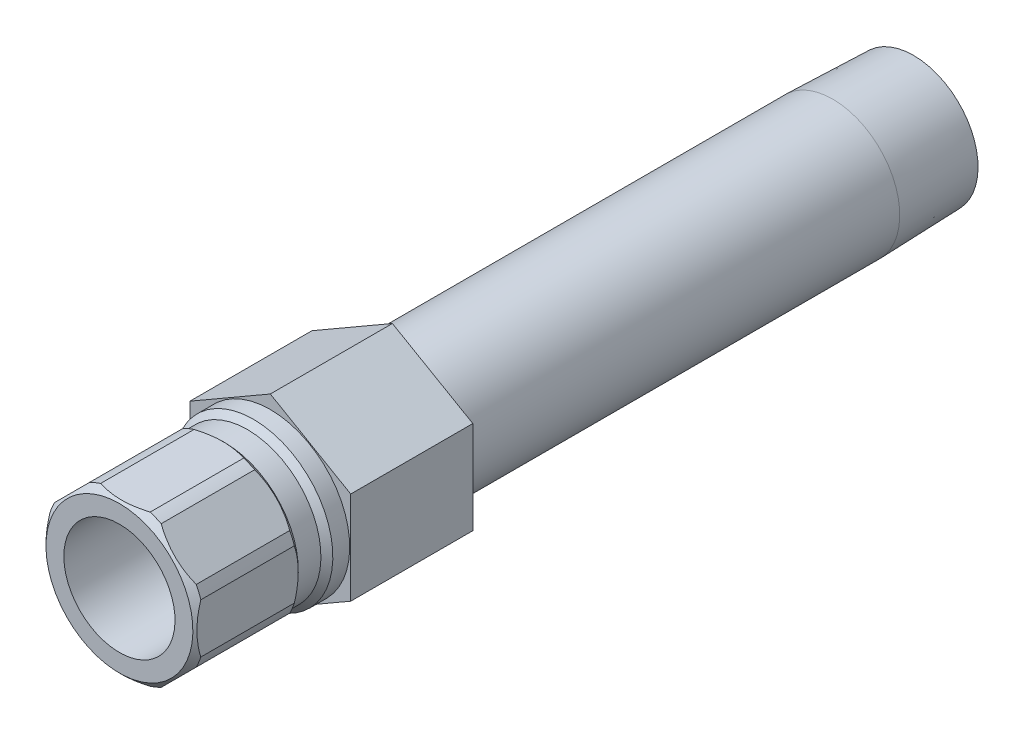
ISO-10303-21;
HEADER;
FILE_DESCRIPTION(('STEP AP214'),'2;1');
FILE_NAME('part.step','',(''),(''),'','','');
FILE_SCHEMA(('AUTOMOTIVE_DESIGN { 1 0 10303 214 1 1 1 1 }'));
ENDSEC;
DATA;
#1=APPLICATION_CONTEXT('core data for automotive mechanical design processes');
#2=APPLICATION_PROTOCOL_DEFINITION('international standard','automotive_design',2000,#1);
#3=PRODUCT_CONTEXT('',#1,'mechanical');
#4=PRODUCT('Part','Part','',(#3));
#5=PRODUCT_RELATED_PRODUCT_CATEGORY('part','',(#4));
#6=PRODUCT_DEFINITION_FORMATION('','',#4);
#7=PRODUCT_DEFINITION_CONTEXT('part definition',#1,'design');
#8=PRODUCT_DEFINITION('design','',#6,#7);
#9=PRODUCT_DEFINITION_SHAPE('','',#8);
#10=(LENGTH_UNIT() NAMED_UNIT(*) SI_UNIT(.MILLI.,.METRE.));
#11=(NAMED_UNIT(*) PLANE_ANGLE_UNIT() SI_UNIT($,.RADIAN.));
#12=(NAMED_UNIT(*) SI_UNIT($,.STERADIAN.) SOLID_ANGLE_UNIT());
#13=UNCERTAINTY_MEASURE_WITH_UNIT(LENGTH_MEASURE(1.E-05),#10,'distance_accuracy_value','');
#14=(GEOMETRIC_REPRESENTATION_CONTEXT(3) GLOBAL_UNCERTAINTY_ASSIGNED_CONTEXT((#13)) GLOBAL_UNIT_ASSIGNED_CONTEXT((#10,
#11,#12)) REPRESENTATION_CONTEXT('',''));
#15=CARTESIAN_POINT('',(0.,0.,0.));
#16=DIRECTION('',(0.,0.,1.));
#17=DIRECTION('',(1.,0.,0.));
#18=AXIS2_PLACEMENT_3D('',#15,#16,#17);
#19=CARTESIAN_POINT('',(0.,0.,0.));
#20=DIRECTION('',(0.,0.,-1.));
#21=DIRECTION('',(0.,1.,0.));
#22=AXIS2_PLACEMENT_3D('',#19,#20,#21);
#23=CYLINDRICAL_SURFACE('',#22,10.16);
#24=DIRECTION('',(0.,0.,-1.));
#25=VECTOR('',#24,1.);
#26=CARTESIAN_POINT('',(9.06826191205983,-4.58172739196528,0.));
#27=LINE('',#26,#25);
#28=CARTESIAN_POINT('',(9.06826191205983,-4.58172739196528,6.5786));
#29=VERTEX_POINT('',#28);
#30=CARTESIAN_POINT('',(9.06826191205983,-4.58172739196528,18.542));
#31=VERTEX_POINT('',#30);
#32=EDGE_CURVE('E525',#29,#31,#27,.F.);
#33=ORIENTED_EDGE('',*,*,#32,.F.);
#34=CARTESIAN_POINT('',(0.,0.,6.5786));
#35=DIRECTION('',(0.,0.,-1.));
#36=DIRECTION('',(0.,1.,0.));
#37=AXIS2_PLACEMENT_3D('',#34,#35,#36);
#38=CIRCLE('',#37,10.16);
#39=CARTESIAN_POINT('',(9.652,-3.17245898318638,6.5786));
#40=VERTEX_POINT('',#39);
#41=EDGE_CURVE('E216',#40,#29,#38,.T.);
#42=ORIENTED_EDGE('',*,*,#41,.F.);
#43=DIRECTION('',(0.,0.,-1.));
#44=VECTOR('',#43,1.);
#45=CARTESIAN_POINT('',(9.652,-3.17245898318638,0.));
#46=LINE('',#45,#44);
#47=CARTESIAN_POINT('',(9.652,-3.17245898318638,18.542));
#48=VERTEX_POINT('',#47);
#49=EDGE_CURVE('E404',#48,#40,#46,.T.);
#50=ORIENTED_EDGE('',*,*,#49,.F.);
#51=CARTESIAN_POINT('',(0.,0.,18.542));
#52=DIRECTION('',(0.,0.,-1.));
#53=DIRECTION('',(0.,1.,0.));
#54=AXIS2_PLACEMENT_3D('',#51,#52,#53);
#55=CIRCLE('',#54,10.16);
#56=EDGE_CURVE('E418',#48,#31,#55,.T.);
#57=ORIENTED_EDGE('',*,*,#56,.T.);
#58=EDGE_LOOP('',(#33,#42,#50,#57));
#59=FACE_BOUND('',#58,.T.);
#60=ADVANCED_FACE('F36',(#59),#23,.T.);
#61=DIRECTION('',(0.,0.,-1.));
#62=VECTOR('',#61,1.);
#63=CARTESIAN_POINT('',(9.652,3.17245898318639,0.));
#64=LINE('',#63,#62);
#65=CARTESIAN_POINT('',(9.652,3.1724589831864,6.57859999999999));
#66=VERTEX_POINT('',#65);
#67=CARTESIAN_POINT('',(9.652,3.17245898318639,18.542));
#68=VERTEX_POINT('',#67);
#69=EDGE_CURVE('E325',#66,#68,#64,.F.);
#70=ORIENTED_EDGE('',*,*,#69,.F.);
#71=CARTESIAN_POINT('',(9.06826191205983,4.58172739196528,6.5786));
#72=VERTEX_POINT('',#71);
#73=EDGE_CURVE('E219',#72,#66,#38,.T.);
#74=ORIENTED_EDGE('',*,*,#73,.F.);
#75=DIRECTION('',(0.,0.,-1.));
#76=VECTOR('',#75,1.);
#77=CARTESIAN_POINT('',(9.06826191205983,4.58172739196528,0.));
#78=LINE('',#77,#76);
#79=CARTESIAN_POINT('',(9.06826191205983,4.58172739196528,18.542));
#80=VERTEX_POINT('',#79);
#81=EDGE_CURVE('E397',#80,#72,#78,.T.);
#82=ORIENTED_EDGE('',*,*,#81,.F.);
#83=EDGE_CURVE('E233',#80,#68,#55,.T.);
#84=ORIENTED_EDGE('',*,*,#83,.T.);
#85=EDGE_LOOP('',(#70,#74,#82,#84));
#86=FACE_BOUND('',#85,.T.);
#87=ADVANCED_FACE('F419',(#86),#23,.T.);
#88=DIRECTION('',(0.,0.,-1.));
#89=VECTOR('',#88,1.);
#90=CARTESIAN_POINT('',(4.58172739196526,9.06826191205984,0.));
#91=LINE('',#90,#89);
#92=CARTESIAN_POINT('',(4.58172739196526,9.06826191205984,6.5786));
#93=VERTEX_POINT('',#92);
#94=CARTESIAN_POINT('',(4.58172739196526,9.06826191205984,18.542));
#95=VERTEX_POINT('',#94);
#96=EDGE_CURVE('E398',#93,#95,#91,.F.);
#97=ORIENTED_EDGE('',*,*,#96,.F.);
#98=CARTESIAN_POINT('',(3.17245898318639,9.652,6.5786));
#99=VERTEX_POINT('',#98);
#100=EDGE_CURVE('E221',#99,#93,#38,.T.);
#101=ORIENTED_EDGE('',*,*,#100,.F.);
#102=DIRECTION('',(0.,0.,-1.));
#103=VECTOR('',#102,1.);
#104=CARTESIAN_POINT('',(3.17245898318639,9.652,0.));
#105=LINE('',#104,#103);
#106=CARTESIAN_POINT('',(3.17245898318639,9.652,18.542));
#107=VERTEX_POINT('',#106);
#108=EDGE_CURVE('E391',#107,#99,#105,.T.);
#109=ORIENTED_EDGE('',*,*,#108,.F.);
#110=EDGE_CURVE('E229',#107,#95,#55,.T.);
#111=ORIENTED_EDGE('',*,*,#110,.T.);
#112=EDGE_LOOP('',(#97,#101,#109,#111));
#113=FACE_BOUND('',#112,.T.);
#114=ADVANCED_FACE('F438',(#113),#23,.T.);
#115=DIRECTION('',(0.,0.,-1.));
#116=VECTOR('',#115,1.);
#117=CARTESIAN_POINT('',(-3.17245898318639,9.652,0.));
#118=LINE('',#117,#116);
#119=CARTESIAN_POINT('',(-3.17245898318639,9.652,6.5786));
#120=VERTEX_POINT('',#119);
#121=CARTESIAN_POINT('',(-3.17245898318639,9.652,18.542));
#122=VERTEX_POINT('',#121);
#123=EDGE_CURVE('E392',#120,#122,#118,.F.);
#124=ORIENTED_EDGE('',*,*,#123,.F.);
#125=CARTESIAN_POINT('',(-4.58172739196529,9.06826191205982,6.5786));
#126=VERTEX_POINT('',#125);
#127=EDGE_CURVE('E226',#126,#120,#38,.T.);
#128=ORIENTED_EDGE('',*,*,#127,.F.);
#129=DIRECTION('',(0.,0.,-1.));
#130=VECTOR('',#129,1.);
#131=CARTESIAN_POINT('',(-4.58172739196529,9.06826191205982,0.));
#132=LINE('',#131,#130);
#133=CARTESIAN_POINT('',(-4.58172739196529,9.06826191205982,18.542));
#134=VERTEX_POINT('',#133);
#135=EDGE_CURVE('E56',#134,#126,#132,.T.);
#136=ORIENTED_EDGE('',*,*,#135,.F.);
#137=EDGE_CURVE('E225',#134,#122,#55,.T.);
#138=ORIENTED_EDGE('',*,*,#137,.T.);
#139=EDGE_LOOP('',(#124,#128,#136,#138));
#140=FACE_BOUND('',#139,.T.);
#141=ADVANCED_FACE('F433',(#140),#23,.T.);
#142=DIRECTION('',(0.,0.,-1.));
#143=VECTOR('',#142,1.);
#144=CARTESIAN_POINT('',(-9.06826191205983,4.58172739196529,0.));
#145=LINE('',#144,#143);
#146=CARTESIAN_POINT('',(-9.06826191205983,4.58172739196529,6.5786));
#147=VERTEX_POINT('',#146);
#148=CARTESIAN_POINT('',(-9.06826191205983,4.58172739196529,18.542));
#149=VERTEX_POINT('',#148);
#150=EDGE_CURVE('E388',#147,#149,#145,.F.);
#151=ORIENTED_EDGE('',*,*,#150,.F.);
#152=CARTESIAN_POINT('',(-9.652,3.17245898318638,6.5786));
#153=VERTEX_POINT('',#152);
#154=EDGE_CURVE('E441',#153,#147,#38,.T.);
#155=ORIENTED_EDGE('',*,*,#154,.F.);
#156=DIRECTION('',(0.,0.,-1.));
#157=VECTOR('',#156,1.);
#158=CARTESIAN_POINT('',(-9.652,3.17245898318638,0.));
#159=LINE('',#158,#157);
#160=CARTESIAN_POINT('',(-9.652,3.17245898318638,18.542));
#161=VERTEX_POINT('',#160);
#162=EDGE_CURVE('E64',#161,#153,#159,.T.);
#163=ORIENTED_EDGE('',*,*,#162,.F.);
#164=EDGE_CURVE('E424',#161,#149,#55,.T.);
#165=ORIENTED_EDGE('',*,*,#164,.T.);
#166=EDGE_LOOP('',(#151,#155,#163,#165));
#167=FACE_BOUND('',#166,.T.);
#168=ADVANCED_FACE('F546',(#167),#23,.T.);
#169=DIRECTION('',(0.,0.,-1.));
#170=VECTOR('',#169,1.);
#171=CARTESIAN_POINT('',(-9.652,-3.17245898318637,0.));
#172=LINE('',#171,#170);
#173=CARTESIAN_POINT('',(-9.652,-3.17245898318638,6.5786));
#174=VERTEX_POINT('',#173);
#175=CARTESIAN_POINT('',(-9.652,-3.17245898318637,18.542));
#176=VERTEX_POINT('',#175);
#177=EDGE_CURVE('E386',#174,#176,#172,.F.);
#178=ORIENTED_EDGE('',*,*,#177,.F.);
#179=CARTESIAN_POINT('',(-9.06826191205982,-4.58172739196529,6.5786));
#180=VERTEX_POINT('',#179);
#181=EDGE_CURVE('E220',#180,#174,#38,.T.);
#182=ORIENTED_EDGE('',*,*,#181,.F.);
#183=DIRECTION('',(0.,0.,-1.));
#184=VECTOR('',#183,1.);
#185=CARTESIAN_POINT('',(-9.06826191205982,-4.58172739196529,0.));
#186=LINE('',#185,#184);
#187=CARTESIAN_POINT('',(-9.06826191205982,-4.58172739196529,18.542));
#188=VERTEX_POINT('',#187);
#189=EDGE_CURVE('E263',#188,#180,#186,.T.);
#190=ORIENTED_EDGE('',*,*,#189,.F.);
#191=EDGE_CURVE('E422',#188,#176,#55,.T.);
#192=ORIENTED_EDGE('',*,*,#191,.T.);
#193=EDGE_LOOP('',(#178,#182,#190,#192));
#194=FACE_BOUND('',#193,.T.);
#195=ADVANCED_FACE('F539',(#194),#23,.T.);
#196=DIRECTION('',(0.,0.,-1.));
#197=VECTOR('',#196,1.);
#198=CARTESIAN_POINT('',(-4.58172739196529,-9.06826191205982,0.));
#199=LINE('',#198,#197);
#200=CARTESIAN_POINT('',(-4.58172739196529,-9.06826191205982,6.5786));
#201=VERTEX_POINT('',#200);
#202=CARTESIAN_POINT('',(-4.58172739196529,-9.06826191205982,18.542));
#203=VERTEX_POINT('',#202);
#204=EDGE_CURVE('E376',#201,#203,#199,.F.);
#205=ORIENTED_EDGE('',*,*,#204,.F.);
#206=CARTESIAN_POINT('',(-3.17245898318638,-9.652,6.5786));
#207=VERTEX_POINT('',#206);
#208=EDGE_CURVE('E217',#207,#201,#38,.T.);
#209=ORIENTED_EDGE('',*,*,#208,.F.);
#210=DIRECTION('',(0.,0.,-1.));
#211=VECTOR('',#210,1.);
#212=CARTESIAN_POINT('',(-3.17245898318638,-9.652,0.));
#213=LINE('',#212,#211);
#214=CARTESIAN_POINT('',(-3.17245898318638,-9.652,18.542));
#215=VERTEX_POINT('',#214);
#216=EDGE_CURVE('E194',#215,#207,#213,.T.);
#217=ORIENTED_EDGE('',*,*,#216,.F.);
#218=EDGE_CURVE('E385',#215,#203,#55,.T.);
#219=ORIENTED_EDGE('',*,*,#218,.T.);
#220=EDGE_LOOP('',(#205,#209,#217,#219));
#221=FACE_BOUND('',#220,.T.);
#222=ADVANCED_FACE('F383',(#221),#23,.T.);
#223=CARTESIAN_POINT('',(0.,0.,0.));
#224=DIRECTION('',(0.,0.,-1.));
#225=DIRECTION('',(0.,1.,0.));
#226=AXIS2_PLACEMENT_3D('',#223,#224,#225);
#227=CYLINDRICAL_SURFACE('',#226,8.5725);
#228=CARTESIAN_POINT('',(0.,0.,-71.9582));
#229=DIRECTION('',(0.,0.,-1.));
#230=DIRECTION('',(0.,1.,0.));
#231=AXIS2_PLACEMENT_3D('',#228,#229,#230);
#232=CIRCLE('',#231,8.5725);
#233=CARTESIAN_POINT('',(0.,8.5725,-71.9582));
#234=VERTEX_POINT('',#233);
#235=EDGE_CURVE('E456',#234,#234,#232,.T.);
#236=ORIENTED_EDGE('',*,*,#235,.F.);
#237=EDGE_LOOP('',(#236));
#238=FACE_BOUND('',#237,.T.);
#239=CARTESIAN_POINT('',(0.,0.,-15.621));
#240=DIRECTION('',(0.,0.,1.));
#241=DIRECTION('',(1.,0.,0.));
#242=AXIS2_PLACEMENT_3D('',#239,#240,#241);
#243=CIRCLE('',#242,8.5725);
#244=CARTESIAN_POINT('',(8.5725,0.,-15.621));
#245=VERTEX_POINT('',#244);
#246=EDGE_CURVE('E471',#245,#245,#243,.F.);
#247=ORIENTED_EDGE('',*,*,#246,.T.);
#248=EDGE_LOOP('',(#247));
#249=FACE_BOUND('',#248,.T.);
#250=ADVANCED_FACE('F538',(#238,#249),#227,.T.);
#251=CARTESIAN_POINT('',(0.,0.,0.));
#252=DIRECTION('',(0.,0.,-1.));
#253=DIRECTION('',(0.,1.,0.));
#254=AXIS2_PLACEMENT_3D('',#251,#252,#253);
#255=CYLINDRICAL_SURFACE('',#254,7.112);
#256=CARTESIAN_POINT('',(0.,0.,1.524));
#257=DIRECTION('',(0.,0.,-1.));
#258=DIRECTION('',(0.,1.,0.));
#259=AXIS2_PLACEMENT_3D('',#256,#257,#258);
#260=CIRCLE('',#259,7.112);
#261=CARTESIAN_POINT('',(0.,7.112,1.524));
#262=VERTEX_POINT('',#261);
#263=EDGE_CURVE('E468',#262,#262,#260,.T.);
#264=ORIENTED_EDGE('',*,*,#263,.T.);
#265=EDGE_LOOP('',(#264));
#266=FACE_BOUND('',#265,.T.);
#267=CARTESIAN_POINT('',(0.,0.,19.304));
#268=DIRECTION('',(0.,0.,-1.));
#269=DIRECTION('',(0.,1.,0.));
#270=AXIS2_PLACEMENT_3D('',#267,#268,#269);
#271=CIRCLE('',#270,7.112);
#272=CARTESIAN_POINT('',(0.,7.112,19.304));
#273=VERTEX_POINT('',#272);
#274=EDGE_CURVE('E200',#273,#273,#271,.T.);
#275=ORIENTED_EDGE('',*,*,#274,.F.);
#276=EDGE_LOOP('',(#275));
#277=FACE_BOUND('',#276,.T.);
#278=ADVANCED_FACE('F38',(#266,#277),#255,.F.);
#279=CARTESIAN_POINT('',(0.,7.112,19.304));
#280=DIRECTION('',(0.,0.,1.));
#281=DIRECTION('',(0.,-1.,0.));
#282=AXIS2_PLACEMENT_3D('',#279,#280,#281);
#283=PLANE('',#282);
#284=ORIENTED_EDGE('',*,*,#274,.T.);
#285=EDGE_LOOP('',(#284));
#286=FACE_BOUND('',#285,.T.);
#287=CARTESIAN_POINT('',(0.,0.,19.304));
#288=DIRECTION('',(0.,0.,-1.));
#289=DIRECTION('',(0.,1.,0.));
#290=AXIS2_PLACEMENT_3D('',#287,#288,#289);
#291=CIRCLE('',#290,9.398);
#292=CARTESIAN_POINT('',(0.,9.398,19.304));
#293=VERTEX_POINT('',#292);
#294=EDGE_CURVE('E232',#293,#293,#291,.T.);
#295=ORIENTED_EDGE('',*,*,#294,.F.);
#296=EDGE_LOOP('',(#295));
#297=FACE_BOUND('',#296,.T.);
#298=ADVANCED_FACE('F269',(#286,#297),#283,.T.);
#299=CARTESIAN_POINT('',(0.,0.,18.542));
#300=DIRECTION('',(0.,0.,-1.));
#301=DIRECTION('',(0.,1.,0.));
#302=AXIS2_PLACEMENT_3D('',#299,#300,#301);
#303=CONICAL_SURFACE('',#302,10.16,0.785398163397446);
#304=CARTESIAN_POINT('',(9.06871478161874,-4.58127452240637,18.5418));
#305=CARTESIAN_POINT('',(8.89746651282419,-4.75252279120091,18.6174888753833));
#306=CARTESIAN_POINT('',(8.72454398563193,-4.92544531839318,18.6860001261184));
#307=CARTESIAN_POINT('',(8.37571487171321,-5.2742744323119,18.8068689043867));
#308=CARTESIAN_POINT('',(8.19980528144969,-5.45018402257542,18.85920901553));
#309=CARTESIAN_POINT('',(7.8498282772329,-5.80016102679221,18.9447662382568));
#310=CARTESIAN_POINT('',(7.67581225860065,-5.97417704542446,18.9783973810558));
#311=CARTESIAN_POINT('',(7.32656572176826,-6.32342358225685,19.0270891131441));
#312=CARTESIAN_POINT('',(7.15133584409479,-6.49865345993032,19.0421588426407));
#313=CARTESIAN_POINT('',(6.77605057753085,-6.87393872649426,19.0538859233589));
#314=CARTESIAN_POINT('',(6.57594647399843,-7.07404283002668,19.0476773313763));
#315=CARTESIAN_POINT('',(6.17675989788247,-7.47322940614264,19.0106603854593));
#316=CARTESIAN_POINT('',(5.97767829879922,-7.67231100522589,18.9798336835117));
#317=CARTESIAN_POINT('',(5.57666706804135,-8.07332223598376,18.8939894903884));
#318=CARTESIAN_POINT('',(5.37480504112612,-8.27518426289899,18.8383431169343));
#319=CARTESIAN_POINT('',(5.07491153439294,-8.57507776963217,18.7386783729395));
#320=CARTESIAN_POINT('',(4.97548345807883,-8.67450584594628,18.7027814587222));
#321=CARTESIAN_POINT('',(4.77762502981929,-8.87236427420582,18.6259657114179));
#322=CARTESIAN_POINT('',(4.67919445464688,-8.97079484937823,18.5850480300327));
#323=CARTESIAN_POINT('',(4.58127452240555,-9.06871478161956,18.5417999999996));
#324=B_SPLINE_CURVE_WITH_KNOTS('',3,(#304,#305,#306,#307,#308,#309,#310,#311,#312,#313,#314,
#315,#316,#317,#318,#319,#320,#321,#322,#323),.UNSPECIFIED.,.F.,.F.,(4,2,2,2,2,2,2,2,2,4),(0.,
0.761268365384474,1.52335378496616,2.26782503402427,3.01192953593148,3.85997332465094,
4.70864975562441,5.58017277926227,6.01546212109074,6.4506517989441),.UNSPECIFIED.);
#325=CARTESIAN_POINT('',(4.58172739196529,-9.06826191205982,18.542));
#326=VERTEX_POINT('',#325);
#327=EDGE_CURVE('E506',#31,#326,#324,.T.);
#328=ORIENTED_EDGE('',*,*,#327,.F.);
#329=ORIENTED_EDGE('',*,*,#56,.F.);
#330=CARTESIAN_POINT('',(9.652,-7.71050187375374,16.3483388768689));
#331=CARTESIAN_POINT('',(9.652,-7.52475481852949,16.4642553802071));
#332=CARTESIAN_POINT('',(9.652,-7.33786285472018,16.5783624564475));
#333=CARTESIAN_POINT('',(9.652,-6.96152272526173,16.8023812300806));
#334=CARTESIAN_POINT('',(9.652,-6.77207395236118,16.9122919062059));
#335=CARTESIAN_POINT('',(9.652,-6.38961701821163,17.1277502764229));
#336=CARTESIAN_POINT('',(9.652,-6.19659699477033,17.2332770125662));
#337=CARTESIAN_POINT('',(9.652,-5.80760245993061,17.4386922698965));
#338=CARTESIAN_POINT('',(9.652,-5.6116281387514,17.5385811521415));
#339=CARTESIAN_POINT('',(9.652,-5.01021259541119,17.8328232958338));
#340=CARTESIAN_POINT('',(9.652,-4.59965798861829,18.0169416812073));
#341=CARTESIAN_POINT('',(9.652,-3.76461195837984,18.3488686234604));
#342=CARTESIAN_POINT('',(9.652,-3.34014745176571,18.4967430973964));
#343=CARTESIAN_POINT('',(9.652,-2.66836152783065,18.6905975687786));
#344=CARTESIAN_POINT('',(9.652,-2.42567962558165,18.7527238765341));
#345=CARTESIAN_POINT('',(9.652,-1.9366245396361,18.860517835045));
#346=CARTESIAN_POINT('',(9.652,-1.69025117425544,18.9061846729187));
#347=CARTESIAN_POINT('',(9.652,-1.1971622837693,18.9790662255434));
#348=CARTESIAN_POINT('',(9.652,-0.95047238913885,19.0064526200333));
#349=CARTESIAN_POINT('',(9.652,-0.45571021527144,19.0423990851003));
#350=CARTESIAN_POINT('',(9.652,-0.207637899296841,19.0509586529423));
#351=CARTESIAN_POINT('',(9.652,0.333683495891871,19.048681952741));
#352=CARTESIAN_POINT('',(9.652,0.626923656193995,19.0340251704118));
#353=CARTESIAN_POINT('',(9.652,1.21094277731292,18.9786837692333));
#354=CARTESIAN_POINT('',(9.652,1.501721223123,18.9379938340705));
#355=CARTESIAN_POINT('',(9.652,2.08266136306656,18.8320509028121));
#356=CARTESIAN_POINT('',(9.652,2.3727646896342,18.7664820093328));
#357=CARTESIAN_POINT('',(9.652,2.94714147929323,18.6138865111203));
#358=CARTESIAN_POINT('',(9.652,3.23141585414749,18.5268632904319));
#359=CARTESIAN_POINT('',(9.652,3.82869981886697,18.3226103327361));
#360=CARTESIAN_POINT('',(9.652,4.14087760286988,18.2029681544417));
#361=CARTESIAN_POINT('',(9.652,4.75742701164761,17.9448741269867));
#362=CARTESIAN_POINT('',(9.652,5.0617950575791,17.8064138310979));
#363=CARTESIAN_POINT('',(9.652,5.66409479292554,17.5139015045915));
#364=CARTESIAN_POINT('',(9.652,5.96200267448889,17.3598008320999));
#365=CARTESIAN_POINT('',(9.652,6.55107386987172,17.0393844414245));
#366=CARTESIAN_POINT('',(9.652,6.84223818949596,16.8730705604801));
#367=CARTESIAN_POINT('',(9.652,7.40668231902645,16.5376791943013));
#368=CARTESIAN_POINT('',(9.652,7.68020242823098,16.3690040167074));
#369=CARTESIAN_POINT('',(9.652,8.22250898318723,16.0241853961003));
#370=CARTESIAN_POINT('',(9.652,8.49129505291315,15.848041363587));
#371=CARTESIAN_POINT('',(9.652,9.02258177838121,15.4910339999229));
#372=CARTESIAN_POINT('',(9.652,9.28511552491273,15.3102197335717));
#373=CARTESIAN_POINT('',(9.652,9.80652727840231,14.9435456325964));
#374=CARTESIAN_POINT('',(9.652,10.0654063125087,14.7576872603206));
#375=CARTESIAN_POINT('',(9.652,10.3227473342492,14.5697596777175));
#376=B_SPLINE_CURVE_WITH_KNOTS('',3,(#330,#331,#332,#333,#334,#335,#336,#337,#338,#339,#340,
#341,#342,#343,#344,#345,#346,#347,#348,#349,#350,#351,#352,#353,#354,#355,#356,#357,#358,#359,
#360,#361,#362,#363,#364,#365,#366,#367,#368,#369,#370,#371,#372,#373,#374,#375),.UNSPECIFIED.,
.F.,.F.,(4,2,2,2,2,2,2,2,2,2,2,2,2,2,2,2,2,2,2,2,2,2,4),(0.,0.656855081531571,1.31386901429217,
1.97372850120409,2.63354568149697,3.98211483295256,5.32821282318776,6.07925616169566,
6.83033658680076,7.5742601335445,8.31820354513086,9.1977741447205,10.0775244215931,
10.9688407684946,11.8600166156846,12.8622077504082,13.8648502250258,14.8707124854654,
15.8764237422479,16.8403261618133,17.8043048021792,18.7605668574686,19.7165545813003),.UNSPECIFIED.);
#377=EDGE_CURVE('E317',#68,#48,#376,.F.);
#378=ORIENTED_EDGE('',*,*,#377,.F.);
#379=ORIENTED_EDGE('',*,*,#83,.F.);
#380=CARTESIAN_POINT('',(4.58127452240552,9.06871478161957,18.5417999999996));
#381=CARTESIAN_POINT('',(4.75252279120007,8.89746651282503,18.617488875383));
#382=CARTESIAN_POINT('',(4.92544531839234,8.72454398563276,18.6860001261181));
#383=CARTESIAN_POINT('',(5.27427443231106,8.37571487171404,18.8068689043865));
#384=CARTESIAN_POINT('',(5.45018402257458,8.19980528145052,18.8592090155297));
#385=CARTESIAN_POINT('',(5.80016102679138,7.84982827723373,18.9447662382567));
#386=CARTESIAN_POINT('',(5.97417704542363,7.67581225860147,18.9783973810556));
#387=CARTESIAN_POINT('',(6.32342358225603,7.32656572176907,19.027089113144));
#388=CARTESIAN_POINT('',(6.4986534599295,7.1513358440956,19.0421588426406));
#389=CARTESIAN_POINT('',(6.87393872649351,6.77605057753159,19.0538859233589));
#390=CARTESIAN_POINT('',(7.074042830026,6.57594647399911,19.0476773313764));
#391=CARTESIAN_POINT('',(7.4732294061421,6.17675989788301,19.0106603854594));
#392=CARTESIAN_POINT('',(7.67231100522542,5.97767829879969,18.9798336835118));
#393=CARTESIAN_POINT('',(8.07332223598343,5.57666706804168,18.8939894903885));
#394=CARTESIAN_POINT('',(8.27518426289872,5.37480504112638,18.8383431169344));
#395=CARTESIAN_POINT('',(8.57507776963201,5.07491153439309,18.7386783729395));
#396=CARTESIAN_POINT('',(8.67450584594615,4.97548345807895,18.7027814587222));
#397=CARTESIAN_POINT('',(8.87236427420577,4.77762502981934,18.6259657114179));
#398=CARTESIAN_POINT('',(8.9707948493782,4.6791944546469,18.5850480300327));
#399=CARTESIAN_POINT('',(9.06871478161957,4.58127452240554,18.5417999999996));
#400=B_SPLINE_CURVE_WITH_KNOTS('',3,(#380,#381,#382,#383,#384,#385,#386,#387,#388,#389,#390,
#391,#392,#393,#394,#395,#396,#397,#398,#399),.UNSPECIFIED.,.F.,.F.,(4,2,2,2,2,2,2,2,2,4),(0.,
0.761268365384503,1.52335378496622,2.26782503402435,3.01192953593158,3.85997332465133,
4.70864975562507,5.58017277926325,6.01546212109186,6.45065179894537),.UNSPECIFIED.);
#401=EDGE_CURVE('E309',#95,#80,#400,.T.);
#402=ORIENTED_EDGE('',*,*,#401,.F.);
#403=ORIENTED_EDGE('',*,*,#110,.F.);
#404=CARTESIAN_POINT('',(-7.71050187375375,9.652,16.3483388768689));
#405=CARTESIAN_POINT('',(-7.5247548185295,9.652,16.4642553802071));
#406=CARTESIAN_POINT('',(-7.33786285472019,9.652,16.5783624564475));
#407=CARTESIAN_POINT('',(-6.96152272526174,9.652,16.8023812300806));
#408=CARTESIAN_POINT('',(-6.77207395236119,9.652,16.9122919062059));
#409=CARTESIAN_POINT('',(-6.38961701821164,9.652,17.1277502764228));
#410=CARTESIAN_POINT('',(-6.19659699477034,9.652,17.2332770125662));
#411=CARTESIAN_POINT('',(-5.80760245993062,9.652,17.4386922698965));
#412=CARTESIAN_POINT('',(-5.61162813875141,9.652,17.5385811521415));
#413=CARTESIAN_POINT('',(-5.0102125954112,9.652,17.8328232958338));
#414=CARTESIAN_POINT('',(-4.5996579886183,9.652,18.0169416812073));
#415=CARTESIAN_POINT('',(-3.76461195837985,9.652,18.3488686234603));
#416=CARTESIAN_POINT('',(-3.34014745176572,9.652,18.4967430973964));
#417=CARTESIAN_POINT('',(-2.66836152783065,9.652,18.6905975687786));
#418=CARTESIAN_POINT('',(-2.42567962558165,9.652,18.7527238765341));
#419=CARTESIAN_POINT('',(-1.9366245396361,9.652,18.860517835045));
#420=CARTESIAN_POINT('',(-1.69025117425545,9.652,18.9061846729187));
#421=CARTESIAN_POINT('',(-1.19716228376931,9.652,18.9790662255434));
#422=CARTESIAN_POINT('',(-0.950472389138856,9.652,19.0064526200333));
#423=CARTESIAN_POINT('',(-0.455710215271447,9.652,19.0423990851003));
#424=CARTESIAN_POINT('',(-0.207637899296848,9.652,19.0509586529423));
#425=CARTESIAN_POINT('',(0.333683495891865,9.652,19.048681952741));
#426=CARTESIAN_POINT('',(0.626923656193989,9.652,19.0340251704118));
#427=CARTESIAN_POINT('',(1.21094277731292,9.652,18.9786837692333));
#428=CARTESIAN_POINT('',(1.50172122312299,9.652,18.9379938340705));
#429=CARTESIAN_POINT('',(2.08266136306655,9.652,18.8320509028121));
#430=CARTESIAN_POINT('',(2.3727646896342,9.652,18.7664820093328));
#431=CARTESIAN_POINT('',(2.94714147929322,9.652,18.6138865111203));
#432=CARTESIAN_POINT('',(3.23141585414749,9.652,18.5268632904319));
#433=CARTESIAN_POINT('',(3.82869981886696,9.652,18.3226103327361));
#434=CARTESIAN_POINT('',(4.14087760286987,9.652,18.2029681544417));
#435=CARTESIAN_POINT('',(4.7574270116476,9.652,17.9448741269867));
#436=CARTESIAN_POINT('',(5.06179505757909,9.652,17.8064138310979));
#437=CARTESIAN_POINT('',(5.66409479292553,9.652,17.5139015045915));
#438=CARTESIAN_POINT('',(5.96200267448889,9.652,17.3598008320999));
#439=CARTESIAN_POINT('',(6.55107386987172,9.652,17.0393844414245));
#440=CARTESIAN_POINT('',(6.84223818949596,9.652,16.8730705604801));
#441=CARTESIAN_POINT('',(7.40668231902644,9.652,16.5376791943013));
#442=CARTESIAN_POINT('',(7.68020242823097,9.652,16.3690040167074));
#443=CARTESIAN_POINT('',(8.22250898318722,9.652,16.0241853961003));
#444=CARTESIAN_POINT('',(8.49129505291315,9.652,15.848041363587));
#445=CARTESIAN_POINT('',(9.0225817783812,9.652,15.4910339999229));
#446=CARTESIAN_POINT('',(9.28511552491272,9.652,15.3102197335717));
#447=CARTESIAN_POINT('',(9.8065272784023,9.652,14.9435456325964));
#448=CARTESIAN_POINT('',(10.0654063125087,9.652,14.7576872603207));
#449=CARTESIAN_POINT('',(10.3227473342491,9.652,14.5697596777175));
#450=B_SPLINE_CURVE_WITH_KNOTS('',3,(#404,#405,#406,#407,#408,#409,#410,#411,#412,#413,#414,
#415,#416,#417,#418,#419,#420,#421,#422,#423,#424,#425,#426,#427,#428,#429,#430,#431,#432,#433,
#434,#435,#436,#437,#438,#439,#440,#441,#442,#443,#444,#445,#446,#447,#448,#449),.UNSPECIFIED.,
.F.,.F.,(4,2,2,2,2,2,2,2,2,2,2,2,2,2,2,2,2,2,2,2,2,2,4),(0.,0.656855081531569,1.31386901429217,
1.97372850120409,2.63354568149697,3.98211483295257,5.32821282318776,6.07925616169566,
6.83033658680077,7.57426013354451,8.31820354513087,9.1977741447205,10.0775244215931,
10.9688407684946,11.8600166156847,12.8622077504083,13.8648502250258,14.8707124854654,
15.8764237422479,16.8403261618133,17.8043048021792,18.7605668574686,19.7165545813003),.UNSPECIFIED.);
#451=EDGE_CURVE('E301',#122,#107,#450,.T.);
#452=ORIENTED_EDGE('',*,*,#451,.F.);
#453=ORIENTED_EDGE('',*,*,#137,.F.);
#454=CARTESIAN_POINT('',(-9.06871478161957,4.58127452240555,18.5417999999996));
#455=CARTESIAN_POINT('',(-8.89746651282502,4.75252279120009,18.617488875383));
#456=CARTESIAN_POINT('',(-8.72454398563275,4.92544531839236,18.6860001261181));
#457=CARTESIAN_POINT('',(-8.37571487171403,5.27427443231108,18.8068689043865));
#458=CARTESIAN_POINT('',(-8.19980528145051,5.4501840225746,18.8592090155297));
#459=CARTESIAN_POINT('',(-7.84982827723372,5.80016102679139,18.9447662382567));
#460=CARTESIAN_POINT('',(-7.67581225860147,5.97417704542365,18.9783973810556));
#461=CARTESIAN_POINT('',(-7.32656572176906,6.32342358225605,19.027089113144));
#462=CARTESIAN_POINT('',(-7.15133584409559,6.49865345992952,19.0421588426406));
#463=CARTESIAN_POINT('',(-6.77605057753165,6.87393872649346,19.0538859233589));
#464=CARTESIAN_POINT('',(-6.57594647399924,7.07404283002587,19.0476773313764));
#465=CARTESIAN_POINT('',(-6.17675989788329,7.47322940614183,19.0106603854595));
#466=CARTESIAN_POINT('',(-5.97767829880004,7.67231100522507,18.9798336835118));
#467=CARTESIAN_POINT('',(-5.57666706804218,8.07332223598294,18.8939894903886));
#468=CARTESIAN_POINT('',(-5.37480504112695,8.27518426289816,18.8383431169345));
#469=CARTESIAN_POINT('',(-5.07491153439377,8.57507776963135,18.7386783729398));
#470=CARTESIAN_POINT('',(-4.97548345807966,8.67450584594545,18.7027814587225));
#471=CARTESIAN_POINT('',(-4.77762502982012,8.872364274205,18.6259657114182));
#472=CARTESIAN_POINT('',(-4.67919445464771,8.9707948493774,18.585048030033));
#473=CARTESIAN_POINT('',(-4.58127452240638,9.06871478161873,18.5418));
#474=B_SPLINE_CURVE_WITH_KNOTS('',3,(#454,#455,#456,#457,#458,#459,#460,#461,#462,#463,#464,
#465,#466,#467,#468,#469,#470,#471,#472,#473),.UNSPECIFIED.,.F.,.F.,(4,2,2,2,2,2,2,2,2,4),(0.,
0.761268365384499,1.52335378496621,2.26782503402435,3.01192953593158,3.85997332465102,
4.70864975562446,5.5801727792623,6.01546212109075,6.4506517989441),.UNSPECIFIED.);
#475=EDGE_CURVE('E292',#149,#134,#474,.T.);
#476=ORIENTED_EDGE('',*,*,#475,.F.);
#477=ORIENTED_EDGE('',*,*,#164,.F.);
#478=CARTESIAN_POINT('',(-9.652,-7.71050187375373,16.3483388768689));
#479=CARTESIAN_POINT('',(-9.652,-7.52475481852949,16.4642553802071));
#480=CARTESIAN_POINT('',(-9.652,-7.33786285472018,16.5783624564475));
#481=CARTESIAN_POINT('',(-9.652,-6.96152272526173,16.8023812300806));
#482=CARTESIAN_POINT('',(-9.652,-6.77207395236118,16.9122919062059));
#483=CARTESIAN_POINT('',(-9.652,-6.38961701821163,17.1277502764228));
#484=CARTESIAN_POINT('',(-9.652,-6.19659699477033,17.2332770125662));
#485=CARTESIAN_POINT('',(-9.652,-5.8076024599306,17.4386922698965));
#486=CARTESIAN_POINT('',(-9.652,-5.6116281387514,17.5385811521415));
#487=CARTESIAN_POINT('',(-9.652,-5.01021259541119,17.8328232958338));
#488=CARTESIAN_POINT('',(-9.652,-4.59965798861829,18.0169416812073));
#489=CARTESIAN_POINT('',(-9.652,-3.76461195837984,18.3488686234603));
#490=CARTESIAN_POINT('',(-9.652,-3.34014745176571,18.4967430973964));
#491=CARTESIAN_POINT('',(-9.652,-2.66836152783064,18.6905975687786));
#492=CARTESIAN_POINT('',(-9.652,-2.42567962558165,18.7527238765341));
#493=CARTESIAN_POINT('',(-9.652,-1.9366245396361,18.860517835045));
#494=CARTESIAN_POINT('',(-9.652,-1.69025117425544,18.9061846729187));
#495=CARTESIAN_POINT('',(-9.652,-1.1971622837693,18.9790662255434));
#496=CARTESIAN_POINT('',(-9.652,-0.950472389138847,19.0064526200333));
#497=CARTESIAN_POINT('',(-9.652,-0.455710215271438,19.0423990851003));
#498=CARTESIAN_POINT('',(-9.652,-0.207637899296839,19.0509586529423));
#499=CARTESIAN_POINT('',(-9.652,0.333683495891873,19.048681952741));
#500=CARTESIAN_POINT('',(-9.652,0.626923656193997,19.0340251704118));
#501=CARTESIAN_POINT('',(-9.652,1.21094277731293,18.9786837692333));
#502=CARTESIAN_POINT('',(-9.652,1.501721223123,18.9379938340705));
#503=CARTESIAN_POINT('',(-9.652,2.08266136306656,18.8320509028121));
#504=CARTESIAN_POINT('',(-9.652,2.3727646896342,18.7664820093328));
#505=CARTESIAN_POINT('',(-9.652,2.94714147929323,18.6138865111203));
#506=CARTESIAN_POINT('',(-9.652,3.23141585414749,18.5268632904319));
#507=CARTESIAN_POINT('',(-9.652,3.82869981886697,18.3226103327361));
#508=CARTESIAN_POINT('',(-9.652,4.14087760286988,18.2029681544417));
#509=CARTESIAN_POINT('',(-9.652,4.75742701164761,17.9448741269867));
#510=CARTESIAN_POINT('',(-9.652,5.0617950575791,17.8064138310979));
#511=CARTESIAN_POINT('',(-9.652,5.66409479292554,17.5139015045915));
#512=CARTESIAN_POINT('',(-9.652,5.9620026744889,17.3598008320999));
#513=CARTESIAN_POINT('',(-9.652,6.55107386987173,17.0393844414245));
#514=CARTESIAN_POINT('',(-9.652,6.84223818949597,16.8730705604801));
#515=CARTESIAN_POINT('',(-9.652,7.40668231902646,16.5376791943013));
#516=CARTESIAN_POINT('',(-9.652,7.68020242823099,16.3690040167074));
#517=CARTESIAN_POINT('',(-9.652,8.22250898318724,16.0241853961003));
#518=CARTESIAN_POINT('',(-9.652,8.49129505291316,15.848041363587));
#519=CARTESIAN_POINT('',(-9.652,9.02258177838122,15.4910339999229));
#520=CARTESIAN_POINT('',(-9.652,9.28511552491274,15.3102197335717));
#521=CARTESIAN_POINT('',(-9.652,9.80652727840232,14.9435456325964));
#522=CARTESIAN_POINT('',(-9.652,10.0654063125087,14.7576872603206));
#523=CARTESIAN_POINT('',(-9.652,10.3227473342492,14.5697596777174));
#524=B_SPLINE_CURVE_WITH_KNOTS('',3,(#478,#479,#480,#481,#482,#483,#484,#485,#486,#487,#488,
#489,#490,#491,#492,#493,#494,#495,#496,#497,#498,#499,#500,#501,#502,#503,#504,#505,#506,#507,
#508,#509,#510,#511,#512,#513,#514,#515,#516,#517,#518,#519,#520,#521,#522,#523),.UNSPECIFIED.,
.F.,.F.,(4,2,2,2,2,2,2,2,2,2,2,2,2,2,2,2,2,2,2,2,2,2,4),(0.,0.656855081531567,1.31386901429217,
1.97372850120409,2.63354568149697,3.98211483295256,5.32821282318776,6.07925616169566,
6.83033658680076,7.5742601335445,8.31820354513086,9.1977741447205,10.0775244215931,
10.9688407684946,11.8600166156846,12.8622077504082,13.8648502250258,14.8707124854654,
15.8764237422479,16.8403261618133,17.8043048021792,18.7605668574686,19.7165545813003),.UNSPECIFIED.);
#525=EDGE_CURVE('E284',#176,#161,#524,.T.);
#526=ORIENTED_EDGE('',*,*,#525,.F.);
#527=ORIENTED_EDGE('',*,*,#191,.F.);
#528=CARTESIAN_POINT('',(-4.58127452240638,-9.06871478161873,18.5418));
#529=CARTESIAN_POINT('',(-4.75252279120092,-8.89746651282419,18.6174888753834));
#530=CARTESIAN_POINT('',(-4.92544531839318,-8.72454398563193,18.6860001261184));
#531=CARTESIAN_POINT('',(-5.2742744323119,-8.37571487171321,18.8068689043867));
#532=CARTESIAN_POINT('',(-5.45018402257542,-8.19980528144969,18.85920901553));
#533=CARTESIAN_POINT('',(-5.80016102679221,-7.8498282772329,18.9447662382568));
#534=CARTESIAN_POINT('',(-5.97417704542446,-7.67581225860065,18.9783973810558));
#535=CARTESIAN_POINT('',(-6.32342358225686,-7.32656572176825,19.0270891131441));
#536=CARTESIAN_POINT('',(-6.49865345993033,-7.15133584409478,19.0421588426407));
#537=CARTESIAN_POINT('',(-6.87393872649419,-6.77605057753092,19.0538859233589));
#538=CARTESIAN_POINT('',(-7.07404283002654,-6.57594647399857,19.0476773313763));
#539=CARTESIAN_POINT('',(-7.47322940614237,-6.17675989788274,19.0106603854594));
#540=CARTESIAN_POINT('',(-7.67231100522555,-5.97767829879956,18.9798336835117));
#541=CARTESIAN_POINT('',(-8.07332223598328,-5.57666706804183,18.8939894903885));
#542=CARTESIAN_POINT('',(-8.27518426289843,-5.37480504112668,18.8383431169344));
#543=CARTESIAN_POINT('',(-8.57507776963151,-5.0749115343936,18.7386783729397));
#544=CARTESIAN_POINT('',(-8.67450584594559,-4.97548345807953,18.7027814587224));
#545=CARTESIAN_POINT('',(-8.87236427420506,-4.77762502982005,18.6259657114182));
#546=CARTESIAN_POINT('',(-8.97079484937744,-4.67919445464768,18.585048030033));
#547=CARTESIAN_POINT('',(-9.06871478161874,-4.58127452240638,18.5418));
#548=B_SPLINE_CURVE_WITH_KNOTS('',3,(#528,#529,#530,#531,#532,#533,#534,#535,#536,#537,#538,
#539,#540,#541,#542,#543,#544,#545,#546,#547),.UNSPECIFIED.,.F.,.F.,(4,2,2,2,2,2,2,2,2,4),(0.,
0.761268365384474,1.52335378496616,2.26782503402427,3.01192953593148,3.85997332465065,
4.70864975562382,5.58017277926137,6.01546212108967,6.45065179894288),.UNSPECIFIED.);
#549=EDGE_CURVE('E277',#203,#188,#548,.T.);
#550=ORIENTED_EDGE('',*,*,#549,.F.);
#551=ORIENTED_EDGE('',*,*,#218,.F.);
#552=CARTESIAN_POINT('',(-7.71050187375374,-9.652,16.3483388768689));
#553=CARTESIAN_POINT('',(-7.52475481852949,-9.652,16.4642553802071));
#554=CARTESIAN_POINT('',(-7.33786285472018,-9.652,16.5783624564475));
#555=CARTESIAN_POINT('',(-6.96152272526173,-9.652,16.8023812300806));
#556=CARTESIAN_POINT('',(-6.77207395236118,-9.652,16.9122919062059));
#557=CARTESIAN_POINT('',(-6.38961701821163,-9.652,17.1277502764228));
#558=CARTESIAN_POINT('',(-6.19659699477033,-9.652,17.2332770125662));
#559=CARTESIAN_POINT('',(-5.80760245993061,-9.652,17.4386922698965));
#560=CARTESIAN_POINT('',(-5.6116281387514,-9.652,17.5385811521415));
#561=CARTESIAN_POINT('',(-5.01021259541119,-9.652,17.8328232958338));
#562=CARTESIAN_POINT('',(-4.59965798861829,-9.652,18.0169416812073));
#563=CARTESIAN_POINT('',(-3.76461195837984,-9.652,18.3488686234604));
#564=CARTESIAN_POINT('',(-3.34014745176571,-9.652,18.4967430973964));
#565=CARTESIAN_POINT('',(-2.66836152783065,-9.652,18.6905975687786));
#566=CARTESIAN_POINT('',(-2.42567962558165,-9.652,18.7527238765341));
#567=CARTESIAN_POINT('',(-1.9366245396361,-9.652,18.860517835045));
#568=CARTESIAN_POINT('',(-1.69025117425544,-9.652,18.9061846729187));
#569=CARTESIAN_POINT('',(-1.1971622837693,-9.652,18.9790662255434));
#570=CARTESIAN_POINT('',(-0.950472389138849,-9.652,19.0064526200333));
#571=CARTESIAN_POINT('',(-0.45571021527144,-9.652,19.0423990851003));
#572=CARTESIAN_POINT('',(-0.20763789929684,-9.652,19.0509586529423));
#573=CARTESIAN_POINT('',(0.333683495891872,-9.652,19.048681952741));
#574=CARTESIAN_POINT('',(0.626923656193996,-9.652,19.0340251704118));
#575=CARTESIAN_POINT('',(1.21094277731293,-9.652,18.9786837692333));
#576=CARTESIAN_POINT('',(1.501721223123,-9.652,18.9379938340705));
#577=CARTESIAN_POINT('',(2.08266136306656,-9.652,18.8320509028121));
#578=CARTESIAN_POINT('',(2.3727646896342,-9.652,18.7664820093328));
#579=CARTESIAN_POINT('',(2.94714147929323,-9.652,18.6138865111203));
#580=CARTESIAN_POINT('',(3.23141585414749,-9.652,18.5268632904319));
#581=CARTESIAN_POINT('',(3.82869981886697,-9.652,18.3226103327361));
#582=CARTESIAN_POINT('',(4.14087760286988,-9.652,18.2029681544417));
#583=CARTESIAN_POINT('',(4.75742701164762,-9.652,17.9448741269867));
#584=CARTESIAN_POINT('',(5.0617950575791,-9.652,17.8064138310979));
#585=CARTESIAN_POINT('',(5.66409479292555,-9.652,17.5139015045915));
#586=CARTESIAN_POINT('',(5.9620026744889,-9.652,17.3598008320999));
#587=CARTESIAN_POINT('',(6.55107386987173,-9.652,17.0393844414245));
#588=CARTESIAN_POINT('',(6.84223818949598,-9.652,16.8730705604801));
#589=CARTESIAN_POINT('',(7.40668231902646,-9.652,16.5376791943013));
#590=CARTESIAN_POINT('',(7.68020242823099,-9.652,16.3690040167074));
#591=CARTESIAN_POINT('',(8.22250898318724,-9.652,16.0241853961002));
#592=CARTESIAN_POINT('',(8.49129505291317,-9.652,15.848041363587));
#593=CARTESIAN_POINT('',(9.02258177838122,-9.652,15.4910339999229));
#594=CARTESIAN_POINT('',(9.28511552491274,-9.652,15.3102197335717));
#595=CARTESIAN_POINT('',(9.80652727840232,-9.652,14.9435456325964));
#596=CARTESIAN_POINT('',(10.0654063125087,-9.652,14.7576872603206));
#597=CARTESIAN_POINT('',(10.3227473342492,-9.652,14.5697596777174));
#598=B_SPLINE_CURVE_WITH_KNOTS('',3,(#552,#553,#554,#555,#556,#557,#558,#559,#560,#561,#562,
#563,#564,#565,#566,#567,#568,#569,#570,#571,#572,#573,#574,#575,#576,#577,#578,#579,#580,#581,
#582,#583,#584,#585,#586,#587,#588,#589,#590,#591,#592,#593,#594,#595,#596,#597),.UNSPECIFIED.,
.F.,.F.,(4,2,2,2,2,2,2,2,2,2,2,2,2,2,2,2,2,2,2,2,2,2,4),(0.,0.656855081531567,1.31386901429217,
1.97372850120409,2.63354568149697,3.98211483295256,5.32821282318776,6.07925616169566,
6.83033658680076,7.5742601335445,8.31820354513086,9.1977741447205,10.0775244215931,
10.9688407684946,11.8600166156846,12.8622077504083,13.8648502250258,14.8707124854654,
15.8764237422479,16.8403261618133,17.8043048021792,18.7605668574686,19.7165545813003),.UNSPECIFIED.);
#599=CARTESIAN_POINT('',(3.17245898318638,-9.652,18.542));
#600=VERTEX_POINT('',#599);
#601=EDGE_CURVE('E210',#600,#215,#598,.F.);
#602=ORIENTED_EDGE('',*,*,#601,.F.);
#603=EDGE_CURVE('E209',#326,#600,#55,.T.);
#604=ORIENTED_EDGE('',*,*,#603,.F.);
#605=EDGE_LOOP('',(#328,#329,#378,#379,#402,#403,#452,#453,#476,#477,#526,#527,#550,#551,#602,#604));
#606=FACE_BOUND('',#605,.T.);
#607=ORIENTED_EDGE('',*,*,#294,.T.);
#608=EDGE_LOOP('',(#607));
#609=FACE_BOUND('',#608,.T.);
#610=ADVANCED_FACE('F266',(#606,#609),#303,.T.);
#611=DIRECTION('',(0.,0.,-1.));
#612=VECTOR('',#611,1.);
#613=CARTESIAN_POINT('',(4.58172739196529,-9.06826191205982,0.));
#614=LINE('',#613,#612);
#615=CARTESIAN_POINT('',(4.58172739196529,-9.06826191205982,6.5786));
#616=VERTEX_POINT('',#615);
#617=EDGE_CURVE('E324',#326,#616,#614,.T.);
#618=ORIENTED_EDGE('',*,*,#617,.F.);
#619=ORIENTED_EDGE('',*,*,#603,.T.);
#620=DIRECTION('',(0.,0.,-1.));
#621=VECTOR('',#620,1.);
#622=CARTESIAN_POINT('',(3.17245898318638,-9.652,0.));
#623=LINE('',#622,#621);
#624=CARTESIAN_POINT('',(3.1724589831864,-9.652,6.57859999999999));
#625=VERTEX_POINT('',#624);
#626=EDGE_CURVE('E191',#625,#600,#623,.F.);
#627=ORIENTED_EDGE('',*,*,#626,.F.);
#628=EDGE_CURVE('E207',#616,#625,#38,.T.);
#629=ORIENTED_EDGE('',*,*,#628,.F.);
#630=EDGE_LOOP('',(#618,#619,#627,#629));
#631=FACE_BOUND('',#630,.T.);
#632=ADVANCED_FACE('F206',(#631),#23,.T.);
#633=CARTESIAN_POINT('',(0.,0.,5.8166));
#634=DIRECTION('',(0.,0.,1.));
#635=DIRECTION('',(0.,-1.,0.));
#636=AXIS2_PLACEMENT_3D('',#633,#634,#635);
#637=CONICAL_SURFACE('',#636,9.398,0.785398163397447);
#638=CARTESIAN_POINT('',(4.58127452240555,-9.06871478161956,6.57880000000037));
#639=CARTESIAN_POINT('',(4.75252279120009,-8.89746651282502,6.50311112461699));
#640=CARTESIAN_POINT('',(4.92544531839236,-8.72454398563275,6.4345998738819));
#641=CARTESIAN_POINT('',(5.27427443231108,-8.37571487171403,6.31373109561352));
#642=CARTESIAN_POINT('',(5.4501840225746,-8.19980528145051,6.26139098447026));
#643=CARTESIAN_POINT('',(5.8001610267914,-7.84982827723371,6.17583376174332));
#644=CARTESIAN_POINT('',(5.97417704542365,-7.67581225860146,6.14220261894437));
#645=CARTESIAN_POINT('',(6.32342358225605,-7.32656572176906,6.09351088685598));
#646=CARTESIAN_POINT('',(6.49865345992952,-7.15133584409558,6.07844115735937));
#647=CARTESIAN_POINT('',(6.87393872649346,-6.77605057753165,6.06671407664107));
#648=CARTESIAN_POINT('',(7.07404283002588,-6.57594647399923,6.07292266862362));
#649=CARTESIAN_POINT('',(7.47322940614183,-6.17675989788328,6.10993961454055));
#650=CARTESIAN_POINT('',(7.67231100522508,-5.97767829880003,6.14076631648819));
#651=CARTESIAN_POINT('',(8.07332223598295,-5.57666706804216,6.22661050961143));
#652=CARTESIAN_POINT('',(8.27518426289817,-5.37480504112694,6.28225688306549));
#653=CARTESIAN_POINT('',(8.57507776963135,-5.07491153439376,6.38192162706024));
#654=CARTESIAN_POINT('',(8.67450584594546,-4.97548345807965,6.41781854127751));
#655=CARTESIAN_POINT('',(8.872364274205,-4.77762502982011,6.49463428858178));
#656=CARTESIAN_POINT('',(8.97079484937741,-4.6791944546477,6.53555196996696));
#657=CARTESIAN_POINT('',(9.06871478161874,-4.58127452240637,6.5788));
#658=B_SPLINE_CURVE_WITH_KNOTS('',3,(#638,#639,#640,#641,#642,#643,#644,#645,#646,#647,#648,
#649,#650,#651,#652,#653,#654,#655,#656,#657),.UNSPECIFIED.,.F.,.F.,(4,2,2,2,2,2,2,2,2,4),(0.,
0.761268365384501,1.52335378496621,2.26782503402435,3.01192953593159,3.85997332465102,
4.70864975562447,5.58017277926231,6.01546212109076,6.45065179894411),.UNSPECIFIED.);
#659=EDGE_CURVE('E12',#616,#29,#658,.T.);
#660=ORIENTED_EDGE('',*,*,#659,.F.);
#661=ORIENTED_EDGE('',*,*,#628,.T.);
#662=CARTESIAN_POINT('',(-7.71050187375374,-9.652,8.77226112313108));
#663=CARTESIAN_POINT('',(-7.52475481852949,-9.652,8.65634461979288));
#664=CARTESIAN_POINT('',(-7.33786285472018,-9.652,8.54223754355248));
#665=CARTESIAN_POINT('',(-6.96152272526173,-9.652,8.31821876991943));
#666=CARTESIAN_POINT('',(-6.77207395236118,-9.652,8.20830809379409));
#667=CARTESIAN_POINT('',(-6.38961701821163,-9.652,7.99284972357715));
#668=CARTESIAN_POINT('',(-6.19659699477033,-9.652,7.88732298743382));
#669=CARTESIAN_POINT('',(-5.80760245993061,-9.652,7.6819077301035));
#670=CARTESIAN_POINT('',(-5.6116281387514,-9.652,7.58201884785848));
#671=CARTESIAN_POINT('',(-5.0102125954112,-9.652,7.28777670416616));
#672=CARTESIAN_POINT('',(-4.59965798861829,-9.652,7.10365831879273));
#673=CARTESIAN_POINT('',(-3.76461195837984,-9.652,6.77173137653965));
#674=CARTESIAN_POINT('',(-3.34014745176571,-9.652,6.6238569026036));
#675=CARTESIAN_POINT('',(-2.66836152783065,-9.652,6.43000243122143));
#676=CARTESIAN_POINT('',(-2.42567962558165,-9.652,6.36787612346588));
#677=CARTESIAN_POINT('',(-1.9366245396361,-9.652,6.26008216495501));
#678=CARTESIAN_POINT('',(-1.69025117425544,-9.652,6.21441532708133));
#679=CARTESIAN_POINT('',(-1.1971622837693,-9.652,6.1415337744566));
#680=CARTESIAN_POINT('',(-0.950472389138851,-9.652,6.11414737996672));
#681=CARTESIAN_POINT('',(-0.455710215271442,-9.652,6.07820091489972));
#682=CARTESIAN_POINT('',(-0.207637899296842,-9.652,6.06964134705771));
#683=CARTESIAN_POINT('',(0.333683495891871,-9.652,6.07191804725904));
#684=CARTESIAN_POINT('',(0.626923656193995,-9.652,6.08657482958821));
#685=CARTESIAN_POINT('',(1.21094277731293,-9.652,6.14191623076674));
#686=CARTESIAN_POINT('',(1.501721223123,-9.652,6.18260616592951));
#687=CARTESIAN_POINT('',(2.08266136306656,-9.652,6.28854909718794));
#688=CARTESIAN_POINT('',(2.37276468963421,-9.652,6.35411799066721));
#689=CARTESIAN_POINT('',(2.94714147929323,-9.652,6.50671348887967));
#690=CARTESIAN_POINT('',(3.2314158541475,-9.652,6.59373670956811));
#691=CARTESIAN_POINT('',(3.82869981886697,-9.652,6.79798966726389));
#692=CARTESIAN_POINT('',(4.14087760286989,-9.652,6.91763184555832));
#693=CARTESIAN_POINT('',(4.75742701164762,-9.652,7.17572587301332));
#694=CARTESIAN_POINT('',(5.06179505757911,-9.652,7.31418616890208));
#695=CARTESIAN_POINT('',(5.66409479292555,-9.652,7.60669849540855));
#696=CARTESIAN_POINT('',(5.96200267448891,-9.652,7.76079916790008));
#697=CARTESIAN_POINT('',(6.55107386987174,-9.652,8.08121555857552));
#698=CARTESIAN_POINT('',(6.84223818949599,-9.652,8.24752943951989));
#699=CARTESIAN_POINT('',(7.40668231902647,-9.652,8.58292080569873));
#700=CARTESIAN_POINT('',(7.680202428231,-9.652,8.75159598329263));
#701=CARTESIAN_POINT('',(8.22250898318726,-9.652,9.09641460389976));
#702=CARTESIAN_POINT('',(8.49129505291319,-9.652,9.27255863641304));
#703=CARTESIAN_POINT('',(9.02258177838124,-9.652,9.62956600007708));
#704=CARTESIAN_POINT('',(9.28511552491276,-9.652,9.81038026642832));
#705=CARTESIAN_POINT('',(9.80652727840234,-9.652,10.1770543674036));
#706=CARTESIAN_POINT('',(10.0654063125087,-9.652,10.3629127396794));
#707=CARTESIAN_POINT('',(10.3227473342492,-9.652,10.5508403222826));
#708=B_SPLINE_CURVE_WITH_KNOTS('',3,(#662,#663,#664,#665,#666,#667,#668,#669,#670,#671,#672,
#673,#674,#675,#676,#677,#678,#679,#680,#681,#682,#683,#684,#685,#686,#687,#688,#689,#690,#691,
#692,#693,#694,#695,#696,#697,#698,#699,#700,#701,#702,#703,#704,#705,#706,#707),.UNSPECIFIED.,
.F.,.F.,(4,2,2,2,2,2,2,2,2,2,2,2,2,2,2,2,2,2,2,2,2,2,4),(0.,0.656855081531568,1.31386901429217,
1.97372850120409,2.63354568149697,3.98211483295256,5.32821282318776,6.07925616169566,
6.83033658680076,7.5742601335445,8.31820354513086,9.1977741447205,10.0775244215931,
10.9688407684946,11.8600166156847,12.8622077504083,13.8648502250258,14.8707124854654,
15.8764237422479,16.8403261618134,17.8043048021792,18.7605668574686,19.7165545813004),.UNSPECIFIED.);
#709=EDGE_CURVE('E188',#207,#625,#708,.T.);
#710=ORIENTED_EDGE('',*,*,#709,.F.);
#711=ORIENTED_EDGE('',*,*,#208,.T.);
#712=CARTESIAN_POINT('',(-9.06871478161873,-4.58127452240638,6.5788));
#713=CARTESIAN_POINT('',(-8.89746651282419,-4.75252279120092,6.50311112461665));
#714=CARTESIAN_POINT('',(-8.72454398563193,-4.92544531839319,6.43459987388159));
#715=CARTESIAN_POINT('',(-8.37571487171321,-5.2742744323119,6.31373109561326));
#716=CARTESIAN_POINT('',(-8.19980528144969,-5.45018402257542,6.26139098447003));
#717=CARTESIAN_POINT('',(-7.8498282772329,-5.80016102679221,6.17583376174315));
#718=CARTESIAN_POINT('',(-7.67581225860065,-5.97417704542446,6.14220261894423));
#719=CARTESIAN_POINT('',(-7.32656572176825,-6.32342358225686,6.0935108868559));
#720=CARTESIAN_POINT('',(-7.15133584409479,-6.49865345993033,6.07844115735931));
#721=CARTESIAN_POINT('',(-6.77605057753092,-6.87393872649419,6.06671407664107));
#722=CARTESIAN_POINT('',(-6.57594647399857,-7.07404283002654,6.07292266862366));
#723=CARTESIAN_POINT('',(-6.17675989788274,-7.47322940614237,6.10993961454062));
#724=CARTESIAN_POINT('',(-5.97767829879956,-7.67231100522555,6.14076631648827));
#725=CARTESIAN_POINT('',(-5.57666706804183,-8.07332223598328,6.22661050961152));
#726=CARTESIAN_POINT('',(-5.37480504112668,-8.27518426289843,6.28225688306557));
#727=CARTESIAN_POINT('',(-5.0749115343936,-8.57507776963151,6.3819216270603));
#728=CARTESIAN_POINT('',(-4.97548345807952,-8.67450584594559,6.41781854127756));
#729=CARTESIAN_POINT('',(-4.77762502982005,-8.87236427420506,6.49463428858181));
#730=CARTESIAN_POINT('',(-4.67919445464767,-8.97079484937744,6.53555196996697));
#731=CARTESIAN_POINT('',(-4.58127452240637,-9.06871478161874,6.5788));
#732=B_SPLINE_CURVE_WITH_KNOTS('',3,(#712,#713,#714,#715,#716,#717,#718,#719,#720,#721,#722,
#723,#724,#725,#726,#727,#728,#729,#730,#731),.UNSPECIFIED.,.F.,.F.,(4,2,2,2,2,2,2,2,2,4),(0.,
0.761268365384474,1.52335378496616,2.26782503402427,3.01192953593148,3.85997332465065,
4.70864975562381,5.58017277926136,6.01546212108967,6.45065179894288),.UNSPECIFIED.);
#733=EDGE_CURVE('E199',#180,#201,#732,.T.);
#734=ORIENTED_EDGE('',*,*,#733,.F.);
#735=ORIENTED_EDGE('',*,*,#181,.T.);
#736=CARTESIAN_POINT('',(-9.652,-7.71050187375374,8.77226112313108));
#737=CARTESIAN_POINT('',(-9.652,-7.5247548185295,8.65634461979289));
#738=CARTESIAN_POINT('',(-9.652,-7.33786285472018,8.54223754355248));
#739=CARTESIAN_POINT('',(-9.652,-6.96152272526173,8.31821876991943));
#740=CARTESIAN_POINT('',(-9.652,-6.77207395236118,8.2083080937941));
#741=CARTESIAN_POINT('',(-9.652,-6.38961701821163,7.99284972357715));
#742=CARTESIAN_POINT('',(-9.652,-6.19659699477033,7.88732298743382));
#743=CARTESIAN_POINT('',(-9.652,-5.80760245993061,7.6819077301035));
#744=CARTESIAN_POINT('',(-9.652,-5.61162813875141,7.58201884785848));
#745=CARTESIAN_POINT('',(-9.652,-5.0102125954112,7.28777670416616));
#746=CARTESIAN_POINT('',(-9.652,-4.59965798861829,7.10365831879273));
#747=CARTESIAN_POINT('',(-9.652,-3.76461195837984,6.77173137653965));
#748=CARTESIAN_POINT('',(-9.652,-3.34014745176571,6.6238569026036));
#749=CARTESIAN_POINT('',(-9.652,-2.66836152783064,6.43000243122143));
#750=CARTESIAN_POINT('',(-9.652,-2.42567962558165,6.36787612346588));
#751=CARTESIAN_POINT('',(-9.652,-1.9366245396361,6.26008216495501));
#752=CARTESIAN_POINT('',(-9.652,-1.69025117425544,6.21441532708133));
#753=CARTESIAN_POINT('',(-9.652,-1.1971622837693,6.1415337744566));
#754=CARTESIAN_POINT('',(-9.652,-0.950472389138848,6.11414737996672));
#755=CARTESIAN_POINT('',(-9.652,-0.455710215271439,6.07820091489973));
#756=CARTESIAN_POINT('',(-9.652,-0.20763789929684,6.06964134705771));
#757=CARTESIAN_POINT('',(-9.652,0.333683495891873,6.07191804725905));
#758=CARTESIAN_POINT('',(-9.652,0.626923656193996,6.08657482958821));
#759=CARTESIAN_POINT('',(-9.652,1.21094277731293,6.14191623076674));
#760=CARTESIAN_POINT('',(-9.652,1.501721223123,6.18260616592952));
#761=CARTESIAN_POINT('',(-9.652,2.08266136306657,6.28854909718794));
#762=CARTESIAN_POINT('',(-9.652,2.37276468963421,6.35411799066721));
#763=CARTESIAN_POINT('',(-9.652,2.94714147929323,6.50671348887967));
#764=CARTESIAN_POINT('',(-9.652,3.2314158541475,6.59373670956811));
#765=CARTESIAN_POINT('',(-9.652,3.82869981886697,6.79798966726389));
#766=CARTESIAN_POINT('',(-9.652,4.14087760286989,6.91763184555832));
#767=CARTESIAN_POINT('',(-9.652,4.75742701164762,7.17572587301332));
#768=CARTESIAN_POINT('',(-9.652,5.06179505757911,7.31418616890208));
#769=CARTESIAN_POINT('',(-9.652,5.66409479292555,7.60669849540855));
#770=CARTESIAN_POINT('',(-9.652,5.96200267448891,7.76079916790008));
#771=CARTESIAN_POINT('',(-9.652,6.55107386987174,8.08121555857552));
#772=CARTESIAN_POINT('',(-9.652,6.84223818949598,8.24752943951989));
#773=CARTESIAN_POINT('',(-9.652,7.40668231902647,8.58292080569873));
#774=CARTESIAN_POINT('',(-9.652,7.680202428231,8.75159598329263));
#775=CARTESIAN_POINT('',(-9.652,8.22250898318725,9.09641460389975));
#776=CARTESIAN_POINT('',(-9.652,8.49129505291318,9.27255863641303));
#777=CARTESIAN_POINT('',(-9.652,9.02258177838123,9.62956600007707));
#778=CARTESIAN_POINT('',(-9.652,9.28511552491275,9.81038026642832));
#779=CARTESIAN_POINT('',(-9.652,9.80652727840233,10.1770543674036));
#780=CARTESIAN_POINT('',(-9.652,10.0654063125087,10.3629127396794));
#781=CARTESIAN_POINT('',(-9.652,10.3227473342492,10.5508403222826));
#782=B_SPLINE_CURVE_WITH_KNOTS('',3,(#736,#737,#738,#739,#740,#741,#742,#743,#744,#745,#746,
#747,#748,#749,#750,#751,#752,#753,#754,#755,#756,#757,#758,#759,#760,#761,#762,#763,#764,#765,
#766,#767,#768,#769,#770,#771,#772,#773,#774,#775,#776,#777,#778,#779,#780,#781),.UNSPECIFIED.,
.F.,.F.,(4,2,2,2,2,2,2,2,2,2,2,2,2,2,2,2,2,2,2,2,2,2,4),(0.,0.656855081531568,1.31386901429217,
1.97372850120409,2.63354568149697,3.98211483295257,5.32821282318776,6.07925616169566,
6.83033658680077,7.57426013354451,8.31820354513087,9.1977741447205,10.0775244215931,
10.9688407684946,11.8600166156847,12.8622077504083,13.8648502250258,14.8707124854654,
15.8764237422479,16.8403261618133,17.8043048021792,18.7605668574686,19.7165545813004),.UNSPECIFIED.);
#783=EDGE_CURVE('E368',#153,#174,#782,.F.);
#784=ORIENTED_EDGE('',*,*,#783,.F.);
#785=ORIENTED_EDGE('',*,*,#154,.T.);
#786=CARTESIAN_POINT('',(-4.58127452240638,9.06871478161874,6.5788));
#787=CARTESIAN_POINT('',(-4.75252279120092,8.8974665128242,6.50311112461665));
#788=CARTESIAN_POINT('',(-4.92544531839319,8.72454398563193,6.43459987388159));
#789=CARTESIAN_POINT('',(-5.2742744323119,8.37571487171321,6.31373109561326));
#790=CARTESIAN_POINT('',(-5.45018402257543,8.19980528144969,6.26139098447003));
#791=CARTESIAN_POINT('',(-5.80016102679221,7.8498282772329,6.17583376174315));
#792=CARTESIAN_POINT('',(-5.97417704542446,7.67581225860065,6.14220261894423));
#793=CARTESIAN_POINT('',(-6.32342358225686,7.32656572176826,6.0935108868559));
#794=CARTESIAN_POINT('',(-6.49865345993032,7.15133584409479,6.07844115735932));
#795=CARTESIAN_POINT('',(-6.87393872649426,6.77605057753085,6.06671407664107));
#796=CARTESIAN_POINT('',(-7.07404283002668,6.57594647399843,6.07292266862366));
#797=CARTESIAN_POINT('',(-7.47322940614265,6.17675989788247,6.10993961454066));
#798=CARTESIAN_POINT('',(-7.6723110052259,5.97767829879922,6.14076631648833));
#799=CARTESIAN_POINT('',(-8.07332223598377,5.57666706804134,6.22661050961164));
#800=CARTESIAN_POINT('',(-8.27518426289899,5.37480504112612,6.28225688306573));
#801=CARTESIAN_POINT('',(-8.57507776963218,5.07491153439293,6.38192162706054));
#802=CARTESIAN_POINT('',(-8.67450584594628,4.97548345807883,6.41781854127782));
#803=CARTESIAN_POINT('',(-8.87236427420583,4.77762502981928,6.49463428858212));
#804=CARTESIAN_POINT('',(-8.97079484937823,4.67919445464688,6.53555196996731));
#805=CARTESIAN_POINT('',(-9.06871478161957,4.58127452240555,6.57880000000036));
#806=B_SPLINE_CURVE_WITH_KNOTS('',3,(#786,#787,#788,#789,#790,#791,#792,#793,#794,#795,#796,
#797,#798,#799,#800,#801,#802,#803,#804,#805),.UNSPECIFIED.,.F.,.F.,(4,2,2,2,2,2,2,2,2,4),(0.,
0.761268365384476,1.52335378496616,2.26782503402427,3.01192953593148,3.85997332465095,
4.70864975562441,5.58017277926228,6.01546212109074,6.45065179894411),.UNSPECIFIED.);
#807=EDGE_CURVE('E351',#126,#147,#806,.T.);
#808=ORIENTED_EDGE('',*,*,#807,.F.);
#809=ORIENTED_EDGE('',*,*,#127,.T.);
#810=CARTESIAN_POINT('',(-7.71050187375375,9.652,8.77226112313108));
#811=CARTESIAN_POINT('',(-7.52475481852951,9.652,8.65634461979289));
#812=CARTESIAN_POINT('',(-7.3378628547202,9.652,8.54223754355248));
#813=CARTESIAN_POINT('',(-6.96152272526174,9.652,8.31821876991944));
#814=CARTESIAN_POINT('',(-6.7720739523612,9.652,8.2083080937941));
#815=CARTESIAN_POINT('',(-6.38961701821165,9.652,7.99284972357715));
#816=CARTESIAN_POINT('',(-6.19659699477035,9.652,7.88732298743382));
#817=CARTESIAN_POINT('',(-5.80760245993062,9.652,7.6819077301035));
#818=CARTESIAN_POINT('',(-5.61162813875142,9.652,7.58201884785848));
#819=CARTESIAN_POINT('',(-5.0102125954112,9.652,7.28777670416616));
#820=CARTESIAN_POINT('',(-4.5996579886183,9.652,7.10365831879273));
#821=CARTESIAN_POINT('',(-3.76461195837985,9.652,6.77173137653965));
#822=CARTESIAN_POINT('',(-3.34014745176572,9.652,6.6238569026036));
#823=CARTESIAN_POINT('',(-2.66836152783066,9.652,6.43000243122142));
#824=CARTESIAN_POINT('',(-2.42567962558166,9.652,6.36787612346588));
#825=CARTESIAN_POINT('',(-1.93662453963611,9.652,6.260082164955));
#826=CARTESIAN_POINT('',(-1.69025117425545,9.652,6.21441532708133));
#827=CARTESIAN_POINT('',(-1.19716228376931,9.652,6.14153377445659));
#828=CARTESIAN_POINT('',(-0.950472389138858,9.652,6.11414737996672));
#829=CARTESIAN_POINT('',(-0.455710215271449,9.652,6.07820091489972));
#830=CARTESIAN_POINT('',(-0.20763789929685,9.652,6.06964134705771));
#831=CARTESIAN_POINT('',(0.333683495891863,9.652,6.07191804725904));
#832=CARTESIAN_POINT('',(0.626923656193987,9.652,6.08657482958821));
#833=CARTESIAN_POINT('',(1.21094277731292,9.652,6.14191623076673));
#834=CARTESIAN_POINT('',(1.50172122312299,9.652,6.18260616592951));
#835=CARTESIAN_POINT('',(2.08266136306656,9.652,6.28854909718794));
#836=CARTESIAN_POINT('',(2.3727646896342,9.652,6.35411799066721));
#837=CARTESIAN_POINT('',(2.94714147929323,9.652,6.50671348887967));
#838=CARTESIAN_POINT('',(3.23141585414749,9.652,6.59373670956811));
#839=CARTESIAN_POINT('',(3.82869981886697,9.652,6.79798966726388));
#840=CARTESIAN_POINT('',(4.14087760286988,9.652,6.91763184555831));
#841=CARTESIAN_POINT('',(4.75742701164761,9.652,7.17572587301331));
#842=CARTESIAN_POINT('',(5.0617950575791,9.652,7.31418616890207));
#843=CARTESIAN_POINT('',(5.66409479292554,9.652,7.60669849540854));
#844=CARTESIAN_POINT('',(5.9620026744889,9.652,7.76079916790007));
#845=CARTESIAN_POINT('',(6.55107386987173,9.652,8.08121555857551));
#846=CARTESIAN_POINT('',(6.84223818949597,9.652,8.24752943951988));
#847=CARTESIAN_POINT('',(7.40668231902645,9.652,8.58292080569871));
#848=CARTESIAN_POINT('',(7.68020242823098,9.652,8.75159598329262));
#849=CARTESIAN_POINT('',(8.22250898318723,9.652,9.09641460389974));
#850=CARTESIAN_POINT('',(8.49129505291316,9.652,9.27255863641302));
#851=CARTESIAN_POINT('',(9.02258177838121,9.652,9.62956600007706));
#852=CARTESIAN_POINT('',(9.28511552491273,9.652,9.8103802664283));
#853=CARTESIAN_POINT('',(9.80652727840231,9.652,10.1770543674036));
#854=CARTESIAN_POINT('',(10.0654063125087,9.652,10.3629127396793));
#855=CARTESIAN_POINT('',(10.3227473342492,9.652,10.5508403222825));
#856=B_SPLINE_CURVE_WITH_KNOTS('',3,(#810,#811,#812,#813,#814,#815,#816,#817,#818,#819,#820,
#821,#822,#823,#824,#825,#826,#827,#828,#829,#830,#831,#832,#833,#834,#835,#836,#837,#838,#839,
#840,#841,#842,#843,#844,#845,#846,#847,#848,#849,#850,#851,#852,#853,#854,#855),.UNSPECIFIED.,
.F.,.F.,(4,2,2,2,2,2,2,2,2,2,2,2,2,2,2,2,2,2,2,2,2,2,4),(0.,0.656855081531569,1.31386901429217,
1.97372850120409,2.63354568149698,3.98211483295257,5.32821282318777,6.07925616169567,
6.83033658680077,7.57426013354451,8.31820354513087,9.19777414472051,10.0775244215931,
10.9688407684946,11.8600166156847,12.8622077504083,13.8648502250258,14.8707124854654,
15.8764237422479,16.8403261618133,17.8043048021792,18.7605668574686,19.7165545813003),.UNSPECIFIED.);
#857=EDGE_CURVE('E346',#99,#120,#856,.F.);
#858=ORIENTED_EDGE('',*,*,#857,.F.);
#859=ORIENTED_EDGE('',*,*,#100,.T.);
#860=CARTESIAN_POINT('',(9.06871478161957,4.58127452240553,6.57880000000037));
#861=CARTESIAN_POINT('',(8.89746651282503,4.75252279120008,6.50311112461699));
#862=CARTESIAN_POINT('',(8.72454398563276,4.92544531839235,6.4345998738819));
#863=CARTESIAN_POINT('',(8.37571487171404,5.27427443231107,6.31373109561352));
#864=CARTESIAN_POINT('',(8.19980528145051,5.45018402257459,6.26139098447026));
#865=CARTESIAN_POINT('',(7.84982827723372,5.80016102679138,6.17583376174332));
#866=CARTESIAN_POINT('',(7.67581225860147,5.97417704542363,6.14220261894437));
#867=CARTESIAN_POINT('',(7.32656572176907,6.32342358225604,6.09351088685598));
#868=CARTESIAN_POINT('',(7.1513358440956,6.49865345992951,6.07844115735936));
#869=CARTESIAN_POINT('',(6.77605057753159,6.87393872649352,6.06671407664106));
#870=CARTESIAN_POINT('',(6.5759464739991,7.07404283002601,6.07292266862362));
#871=CARTESIAN_POINT('',(6.176759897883,7.4732294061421,6.10993961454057));
#872=CARTESIAN_POINT('',(5.97767829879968,7.67231100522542,6.14076631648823));
#873=CARTESIAN_POINT('',(5.57666706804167,8.07332223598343,6.22661050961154));
#874=CARTESIAN_POINT('',(5.37480504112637,8.27518426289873,6.28225688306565));
#875=CARTESIAN_POINT('',(5.07491153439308,8.57507776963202,6.38192162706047));
#876=CARTESIAN_POINT('',(4.97548345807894,8.67450584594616,6.41781854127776));
#877=CARTESIAN_POINT('',(4.77762502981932,8.87236427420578,6.49463428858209));
#878=CARTESIAN_POINT('',(4.67919445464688,8.97079484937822,6.53555196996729));
#879=CARTESIAN_POINT('',(4.58127452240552,9.06871478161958,6.57880000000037));
#880=B_SPLINE_CURVE_WITH_KNOTS('',3,(#860,#861,#862,#863,#864,#865,#866,#867,#868,#869,#870,
#871,#872,#873,#874,#875,#876,#877,#878,#879),.UNSPECIFIED.,.F.,.F.,(4,2,2,2,2,2,2,2,2,4),(0.,
0.761268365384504,1.52335378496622,2.26782503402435,3.01192953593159,3.85997332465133,
4.70864975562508,5.58017277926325,6.01546212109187,6.45065179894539),.UNSPECIFIED.);
#881=EDGE_CURVE('E341',#72,#93,#880,.T.);
#882=ORIENTED_EDGE('',*,*,#881,.F.);
#883=ORIENTED_EDGE('',*,*,#73,.T.);
#884=CARTESIAN_POINT('',(9.652,-7.71050187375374,8.77226112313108));
#885=CARTESIAN_POINT('',(9.652,-7.5247548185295,8.65634461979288));
#886=CARTESIAN_POINT('',(9.652,-7.33786285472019,8.54223754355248));
#887=CARTESIAN_POINT('',(9.652,-6.96152272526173,8.31821876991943));
#888=CARTESIAN_POINT('',(9.652,-6.77207395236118,8.20830809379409));
#889=CARTESIAN_POINT('',(9.652,-6.38961701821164,7.99284972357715));
#890=CARTESIAN_POINT('',(9.652,-6.19659699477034,7.88732298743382));
#891=CARTESIAN_POINT('',(9.652,-5.80760245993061,7.6819077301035));
#892=CARTESIAN_POINT('',(9.652,-5.61162813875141,7.58201884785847));
#893=CARTESIAN_POINT('',(9.652,-5.0102125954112,7.28777670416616));
#894=CARTESIAN_POINT('',(9.652,-4.59965798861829,7.10365831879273));
#895=CARTESIAN_POINT('',(9.652,-3.76461195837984,6.77173137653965));
#896=CARTESIAN_POINT('',(9.652,-3.34014745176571,6.6238569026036));
#897=CARTESIAN_POINT('',(9.652,-2.66836152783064,6.43000243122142));
#898=CARTESIAN_POINT('',(9.652,-2.42567962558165,6.36787612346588));
#899=CARTESIAN_POINT('',(9.652,-1.9366245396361,6.260082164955));
#900=CARTESIAN_POINT('',(9.652,-1.69025117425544,6.21441532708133));
#901=CARTESIAN_POINT('',(9.652,-1.1971622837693,6.1415337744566));
#902=CARTESIAN_POINT('',(9.652,-0.950472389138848,6.11414737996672));
#903=CARTESIAN_POINT('',(9.652,-0.455710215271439,6.07820091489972));
#904=CARTESIAN_POINT('',(9.652,-0.20763789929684,6.06964134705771));
#905=CARTESIAN_POINT('',(9.652,0.333683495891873,6.07191804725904));
#906=CARTESIAN_POINT('',(9.652,0.626923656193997,6.08657482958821));
#907=CARTESIAN_POINT('',(9.652,1.21094277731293,6.14191623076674));
#908=CARTESIAN_POINT('',(9.652,1.501721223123,6.18260616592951));
#909=CARTESIAN_POINT('',(9.652,2.08266136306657,6.28854909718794));
#910=CARTESIAN_POINT('',(9.652,2.37276468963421,6.35411799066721));
#911=CARTESIAN_POINT('',(9.652,2.94714147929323,6.50671348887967));
#912=CARTESIAN_POINT('',(9.652,3.2314158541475,6.59373670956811));
#913=CARTESIAN_POINT('',(9.652,3.82869981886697,6.79798966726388));
#914=CARTESIAN_POINT('',(9.652,4.14087760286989,6.91763184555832));
#915=CARTESIAN_POINT('',(9.652,4.75742701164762,7.17572587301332));
#916=CARTESIAN_POINT('',(9.652,5.06179505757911,7.31418616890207));
#917=CARTESIAN_POINT('',(9.652,5.66409479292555,7.60669849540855));
#918=CARTESIAN_POINT('',(9.652,5.96200267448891,7.76079916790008));
#919=CARTESIAN_POINT('',(9.652,6.55107386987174,8.08121555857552));
#920=CARTESIAN_POINT('',(9.652,6.84223818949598,8.24752943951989));
#921=CARTESIAN_POINT('',(9.652,7.40668231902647,8.58292080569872));
#922=CARTESIAN_POINT('',(9.652,7.680202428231,8.75159598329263));
#923=CARTESIAN_POINT('',(9.652,8.22250898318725,9.09641460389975));
#924=CARTESIAN_POINT('',(9.652,8.49129505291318,9.27255863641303));
#925=CARTESIAN_POINT('',(9.652,9.02258177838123,9.62956600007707));
#926=CARTESIAN_POINT('',(9.652,9.28511552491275,9.81038026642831));
#927=CARTESIAN_POINT('',(9.652,9.80652727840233,10.1770543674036));
#928=CARTESIAN_POINT('',(9.652,10.0654063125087,10.3629127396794));
#929=CARTESIAN_POINT('',(9.652,10.3227473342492,10.5508403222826));
#930=B_SPLINE_CURVE_WITH_KNOTS('',3,(#884,#885,#886,#887,#888,#889,#890,#891,#892,#893,#894,
#895,#896,#897,#898,#899,#900,#901,#902,#903,#904,#905,#906,#907,#908,#909,#910,#911,#912,#913,
#914,#915,#916,#917,#918,#919,#920,#921,#922,#923,#924,#925,#926,#927,#928,#929),.UNSPECIFIED.,
.F.,.F.,(4,2,2,2,2,2,2,2,2,2,2,2,2,2,2,2,2,2,2,2,2,2,4),(0.,0.656855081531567,1.31386901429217,
1.97372850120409,2.63354568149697,3.98211483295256,5.32821282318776,6.07925616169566,
6.83033658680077,7.57426013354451,8.31820354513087,9.1977741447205,10.0775244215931,
10.9688407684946,11.8600166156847,12.8622077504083,13.8648502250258,14.8707124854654,
15.8764237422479,16.8403261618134,17.8043048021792,18.7605668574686,19.7165545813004),.UNSPECIFIED.);
#931=EDGE_CURVE('E49',#40,#66,#930,.T.);
#932=ORIENTED_EDGE('',*,*,#931,.F.);
#933=ORIENTED_EDGE('',*,*,#41,.T.);
#934=EDGE_LOOP('',(#660,#661,#710,#711,#734,#735,#784,#785,#808,#809,#858,#859,#882,#883,#932,#933));
#935=FACE_BOUND('',#934,.T.);
#936=CARTESIAN_POINT('',(0.,0.,5.8166));
#937=DIRECTION('',(0.,0.,-1.));
#938=DIRECTION('',(0.,1.,0.));
#939=AXIS2_PLACEMENT_3D('',#936,#937,#938);
#940=CIRCLE('',#939,9.398);
#941=CARTESIAN_POINT('',(0.,9.398,5.8166));
#942=VERTEX_POINT('',#941);
#943=EDGE_CURVE('E227',#942,#942,#940,.T.);
#944=ORIENTED_EDGE('',*,*,#943,.F.);
#945=EDGE_LOOP('',(#944));
#946=FACE_BOUND('',#945,.T.);
#947=ADVANCED_FACE('F213',(#935,#946),#637,.T.);
#948=CARTESIAN_POINT('',(0.,0.,0.));
#949=DIRECTION('',(0.,0.,-1.));
#950=DIRECTION('',(0.,1.,0.));
#951=AXIS2_PLACEMENT_3D('',#948,#949,#950);
#952=CYLINDRICAL_SURFACE('',#951,9.398);
#953=ORIENTED_EDGE('',*,*,#943,.T.);
#954=EDGE_LOOP('',(#953));
#955=FACE_BOUND('',#954,.T.);
#956=CARTESIAN_POINT('',(0.,0.,2.921));
#957=DIRECTION('',(0.,0.,-1.));
#958=DIRECTION('',(0.,1.,0.));
#959=AXIS2_PLACEMENT_3D('',#956,#957,#958);
#960=CIRCLE('',#959,9.398);
#961=CARTESIAN_POINT('',(0.,9.398,2.921));
#962=VERTEX_POINT('',#961);
#963=EDGE_CURVE('E443',#962,#962,#960,.T.);
#964=ORIENTED_EDGE('',*,*,#963,.F.);
#965=EDGE_LOOP('',(#964));
#966=FACE_BOUND('',#965,.T.);
#967=ADVANCED_FACE('F536',(#955,#966),#952,.T.);
#968=CARTESIAN_POINT('',(0.,0.,2.159));
#969=DIRECTION('',(0.,0.,-1.));
#970=DIRECTION('',(0.,1.,0.));
#971=AXIS2_PLACEMENT_3D('',#968,#969,#970);
#972=CONICAL_SURFACE('',#971,10.16,0.785398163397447);
#973=ORIENTED_EDGE('',*,*,#963,.T.);
#974=EDGE_LOOP('',(#973));
#975=FACE_BOUND('',#974,.T.);
#976=CARTESIAN_POINT('',(0.,0.,2.159));
#977=DIRECTION('',(0.,0.,-1.));
#978=DIRECTION('',(0.,1.,0.));
#979=AXIS2_PLACEMENT_3D('',#976,#977,#978);
#980=CIRCLE('',#979,10.16);
#981=CARTESIAN_POINT('',(0.,10.16,2.159));
#982=VERTEX_POINT('',#981);
#983=EDGE_CURVE('E447',#982,#982,#980,.T.);
#984=ORIENTED_EDGE('',*,*,#983,.F.);
#985=EDGE_LOOP('',(#984));
#986=FACE_BOUND('',#985,.T.);
#987=ADVANCED_FACE('F704',(#975,#986),#972,.T.);
#988=CARTESIAN_POINT('',(0.,0.,0.));
#989=DIRECTION('',(0.,0.,-1.));
#990=DIRECTION('',(0.,1.,0.));
#991=AXIS2_PLACEMENT_3D('',#988,#989,#990);
#992=CYLINDRICAL_SURFACE('',#991,10.16);
#993=ORIENTED_EDGE('',*,*,#983,.T.);
#994=EDGE_LOOP('',(#993));
#995=FACE_BOUND('',#994,.T.);
#996=CARTESIAN_POINT('',(0.,0.,0.));
#997=DIRECTION('',(0.,0.,-1.));
#998=DIRECTION('',(0.,1.,0.));
#999=AXIS2_PLACEMENT_3D('',#996,#997,#998);
#1000=CIRCLE('',#999,10.16);
#1001=CARTESIAN_POINT('',(0.,10.16,0.));
#1002=VERTEX_POINT('',#1001);
#1003=EDGE_CURVE('E451',#1002,#1002,#1000,.T.);
#1004=ORIENTED_EDGE('',*,*,#1003,.F.);
#1005=EDGE_LOOP('',(#1004));
#1006=FACE_BOUND('',#1005,.T.);
#1007=ADVANCED_FACE('F694',(#995,#1006),#992,.T.);
#1008=CARTESIAN_POINT('',(0.,0.,-82.296));
#1009=DIRECTION('',(0.,0.,1.));
#1010=DIRECTION('',(0.,-1.,0.));
#1011=AXIS2_PLACEMENT_3D('',#1008,#1009,#1010);
#1012=CONICAL_SURFACE('',#1011,8.24944566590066,0.0312396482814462);
#1013=ORIENTED_EDGE('',*,*,#235,.T.);
#1014=EDGE_LOOP('',(#1013));
#1015=FACE_BOUND('',#1014,.T.);
#1016=CARTESIAN_POINT('',(0.,0.,-82.296));
#1017=DIRECTION('',(0.,0.,-1.));
#1018=DIRECTION('',(0.,1.,0.));
#1019=AXIS2_PLACEMENT_3D('',#1016,#1017,#1018);
#1020=CIRCLE('',#1019,8.24944566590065);
#1021=CARTESIAN_POINT('',(0.,8.24944566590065,-82.296));
#1022=VERTEX_POINT('',#1021);
#1023=EDGE_CURVE('E459',#1022,#1022,#1020,.T.);
#1024=ORIENTED_EDGE('',*,*,#1023,.F.);
#1025=EDGE_LOOP('',(#1024));
#1026=FACE_BOUND('',#1025,.T.);
#1027=ADVANCED_FACE('F684',(#1015,#1026),#1012,.T.);
#1028=CARTESIAN_POINT('',(0.,8.24944566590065,-82.296));
#1029=DIRECTION('',(0.,0.,-1.));
#1030=DIRECTION('',(0.,1.,0.));
#1031=AXIS2_PLACEMENT_3D('',#1028,#1029,#1030);
#1032=PLANE('',#1031);
#1033=ORIENTED_EDGE('',*,*,#1023,.T.);
#1034=EDGE_LOOP('',(#1033));
#1035=FACE_BOUND('',#1034,.T.);
#1036=CARTESIAN_POINT('',(0.,0.,-82.296));
#1037=DIRECTION('',(0.,0.,-1.));
#1038=DIRECTION('',(0.,1.,0.));
#1039=AXIS2_PLACEMENT_3D('',#1036,#1037,#1038);
#1040=CIRCLE('',#1039,6.2611);
#1041=CARTESIAN_POINT('',(0.,6.2611,-82.296));
#1042=VERTEX_POINT('',#1041);
#1043=EDGE_CURVE('E462',#1042,#1042,#1040,.T.);
#1044=ORIENTED_EDGE('',*,*,#1043,.F.);
#1045=EDGE_LOOP('',(#1044));
#1046=FACE_BOUND('',#1045,.T.);
#1047=ADVANCED_FACE('F660',(#1035,#1046),#1032,.T.);
#1048=CARTESIAN_POINT('',(0.,0.,0.));
#1049=DIRECTION('',(0.,0.,-1.));
#1050=DIRECTION('',(0.,1.,0.));
#1051=AXIS2_PLACEMENT_3D('',#1048,#1049,#1050);
#1052=CYLINDRICAL_SURFACE('',#1051,6.2611);
#1053=CARTESIAN_POINT('',(0.,0.,0.673100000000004));
#1054=DIRECTION('',(0.,0.,-1.));
#1055=DIRECTION('',(0.,1.,0.));
#1056=AXIS2_PLACEMENT_3D('',#1053,#1054,#1055);
#1057=CIRCLE('',#1056,6.2611);
#1058=CARTESIAN_POINT('',(0.,6.2611,0.673100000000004));
#1059=VERTEX_POINT('',#1058);
#1060=EDGE_CURVE('E465',#1059,#1059,#1057,.T.);
#1061=ORIENTED_EDGE('',*,*,#1060,.F.);
#1062=EDGE_LOOP('',(#1061));
#1063=FACE_BOUND('',#1062,.T.);
#1064=ORIENTED_EDGE('',*,*,#1043,.T.);
#1065=EDGE_LOOP('',(#1064));
#1066=FACE_BOUND('',#1065,.T.);
#1067=ADVANCED_FACE('F655',(#1063,#1066),#1052,.F.);
#1068=CARTESIAN_POINT('',(0.,0.,1.524));
#1069=DIRECTION('',(0.,0.,1.));
#1070=DIRECTION('',(0.,-1.,0.));
#1071=AXIS2_PLACEMENT_3D('',#1068,#1069,#1070);
#1072=CONICAL_SURFACE('',#1071,7.112,0.78539816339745);
#1073=ORIENTED_EDGE('',*,*,#1060,.T.);
#1074=EDGE_LOOP('',(#1073));
#1075=FACE_BOUND('',#1074,.T.);
#1076=ORIENTED_EDGE('',*,*,#263,.F.);
#1077=EDGE_LOOP('',(#1076));
#1078=FACE_BOUND('',#1077,.T.);
#1079=ADVANCED_FACE('F647',(#1075,#1078),#1072,.F.);
#1080=CARTESIAN_POINT('',(0.,11.8784044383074,-15.621));
#1081=DIRECTION('',(-0.5,0.866025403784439,0.));
#1082=DIRECTION('',(-0.866025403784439,-0.5,0.));
#1083=AXIS2_PLACEMENT_3D('',#1080,#1081,#1082);
#1084=PLANE('',#1083);
#1085=DIRECTION('',(-0.866025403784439,-0.5,0.));
#1086=VECTOR('',#1085,1.);
#1087=CARTESIAN_POINT('',(0.,11.8784044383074,0.));
#1088=LINE('',#1087,#1086);
#1089=CARTESIAN_POINT('',(0.,11.8784044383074,0.));
#1090=VERTEX_POINT('',#1089);
#1091=CARTESIAN_POINT('',(-10.287,5.93920221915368,0.));
#1092=VERTEX_POINT('',#1091);
#1093=EDGE_CURVE('E503',#1090,#1092,#1088,.T.);
#1094=ORIENTED_EDGE('',*,*,#1093,.F.);
#1095=DIRECTION('',(0.,0.,1.));
#1096=VECTOR('',#1095,1.);
#1097=CARTESIAN_POINT('',(0.,11.8784044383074,-15.621));
#1098=LINE('',#1097,#1096);
#1099=CARTESIAN_POINT('',(0.,11.8784044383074,-15.621));
#1100=VERTEX_POINT('',#1099);
#1101=EDGE_CURVE('E474',#1100,#1090,#1098,.T.);
#1102=ORIENTED_EDGE('',*,*,#1101,.F.);
#1103=DIRECTION('',(-0.866025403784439,-0.5,0.));
#1104=VECTOR('',#1103,1.);
#1105=CARTESIAN_POINT('',(0.,11.8784044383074,-15.621));
#1106=LINE('',#1105,#1104);
#1107=CARTESIAN_POINT('',(-10.287,5.93920221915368,-15.621));
#1108=VERTEX_POINT('',#1107);
#1109=EDGE_CURVE('E490',#1100,#1108,#1106,.T.);
#1110=ORIENTED_EDGE('',*,*,#1109,.T.);
#1111=DIRECTION('',(0.,0.,1.));
#1112=VECTOR('',#1111,1.);
#1113=CARTESIAN_POINT('',(-10.287,5.93920221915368,-15.621));
#1114=LINE('',#1113,#1112);
#1115=EDGE_CURVE('E475',#1108,#1092,#1114,.T.);
#1116=ORIENTED_EDGE('',*,*,#1115,.T.);
#1117=EDGE_LOOP('',(#1094,#1102,#1110,#1116));
#1118=FACE_BOUND('',#1117,.T.);
#1119=ADVANCED_FACE('F637',(#1118),#1084,.T.);
#1120=CARTESIAN_POINT('',(10.287,5.93920221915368,-15.621));
#1121=DIRECTION('',(0.5,0.866025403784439,0.));
#1122=DIRECTION('',(-0.866025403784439,0.5,0.));
#1123=AXIS2_PLACEMENT_3D('',#1120,#1121,#1122);
#1124=PLANE('',#1123);
#1125=DIRECTION('',(-0.866025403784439,0.5,0.));
#1126=VECTOR('',#1125,1.);
#1127=CARTESIAN_POINT('',(10.287,5.93920221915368,0.));
#1128=LINE('',#1127,#1126);
#1129=CARTESIAN_POINT('',(10.287,5.93920221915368,0.));
#1130=VERTEX_POINT('',#1129);
#1131=EDGE_CURVE('E487',#1130,#1090,#1128,.T.);
#1132=ORIENTED_EDGE('',*,*,#1131,.F.);
#1133=DIRECTION('',(0.,0.,1.));
#1134=VECTOR('',#1133,1.);
#1135=CARTESIAN_POINT('',(10.287,5.93920221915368,-15.621));
#1136=LINE('',#1135,#1134);
#1137=CARTESIAN_POINT('',(10.287,5.93920221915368,-15.621));
#1138=VERTEX_POINT('',#1137);
#1139=EDGE_CURVE('E484',#1138,#1130,#1136,.T.);
#1140=ORIENTED_EDGE('',*,*,#1139,.F.);
#1141=DIRECTION('',(-0.866025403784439,0.5,0.));
#1142=VECTOR('',#1141,1.);
#1143=CARTESIAN_POINT('',(10.287,5.93920221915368,-15.621));
#1144=LINE('',#1143,#1142);
#1145=EDGE_CURVE('E478',#1138,#1100,#1144,.T.);
#1146=ORIENTED_EDGE('',*,*,#1145,.T.);
#1147=ORIENTED_EDGE('',*,*,#1101,.T.);
#1148=EDGE_LOOP('',(#1132,#1140,#1146,#1147));
#1149=FACE_BOUND('',#1148,.T.);
#1150=ADVANCED_FACE('F627',(#1149),#1124,.T.);
#1151=CARTESIAN_POINT('',(10.287,-5.93920221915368,-15.621));
#1152=DIRECTION('',(1.,0.,0.));
#1153=DIRECTION('',(0.,0.,-1.));
#1154=AXIS2_PLACEMENT_3D('',#1151,#1152,#1153);
#1155=PLANE('',#1154);
#1156=DIRECTION('',(0.,1.,0.));
#1157=VECTOR('',#1156,1.);
#1158=CARTESIAN_POINT('',(10.287,-5.93920221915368,0.));
#1159=LINE('',#1158,#1157);
#1160=CARTESIAN_POINT('',(10.287,-5.93920221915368,0.));
#1161=VERTEX_POINT('',#1160);
#1162=EDGE_CURVE('E491',#1161,#1130,#1159,.T.);
#1163=ORIENTED_EDGE('',*,*,#1162,.F.);
#1164=DIRECTION('',(0.,0.,1.));
#1165=VECTOR('',#1164,1.);
#1166=CARTESIAN_POINT('',(10.287,-5.93920221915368,-15.621));
#1167=LINE('',#1166,#1165);
#1168=CARTESIAN_POINT('',(10.287,-5.93920221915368,-15.621));
#1169=VERTEX_POINT('',#1168);
#1170=EDGE_CURVE('E482',#1169,#1161,#1167,.T.);
#1171=ORIENTED_EDGE('',*,*,#1170,.F.);
#1172=DIRECTION('',(0.,1.,0.));
#1173=VECTOR('',#1172,1.);
#1174=CARTESIAN_POINT('',(10.287,-5.93920221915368,-15.621));
#1175=LINE('',#1174,#1173);
#1176=EDGE_CURVE('E509',#1169,#1138,#1175,.T.);
#1177=ORIENTED_EDGE('',*,*,#1176,.T.);
#1178=ORIENTED_EDGE('',*,*,#1139,.T.);
#1179=EDGE_LOOP('',(#1163,#1171,#1177,#1178));
#1180=FACE_BOUND('',#1179,.T.);
#1181=ADVANCED_FACE('F617',(#1180),#1155,.T.);
#1182=CARTESIAN_POINT('',(0.,-11.8784044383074,-15.621));
#1183=DIRECTION('',(0.5,-0.866025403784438,0.));
#1184=DIRECTION('',(0.866025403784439,0.5,0.));
#1185=AXIS2_PLACEMENT_3D('',#1182,#1183,#1184);
#1186=PLANE('',#1185);
#1187=DIRECTION('',(0.866025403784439,0.5,0.));
#1188=VECTOR('',#1187,1.);
#1189=CARTESIAN_POINT('',(0.,-11.8784044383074,0.));
#1190=LINE('',#1189,#1188);
#1191=CARTESIAN_POINT('',(0.,-11.8784044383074,0.));
#1192=VERTEX_POINT('',#1191);
#1193=EDGE_CURVE('E494',#1192,#1161,#1190,.T.);
#1194=ORIENTED_EDGE('',*,*,#1193,.F.);
#1195=DIRECTION('',(0.,0.,1.));
#1196=VECTOR('',#1195,1.);
#1197=CARTESIAN_POINT('',(0.,-11.8784044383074,-15.621));
#1198=LINE('',#1197,#1196);
#1199=CARTESIAN_POINT('',(0.,-11.8784044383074,-15.621));
#1200=VERTEX_POINT('',#1199);
#1201=EDGE_CURVE('E480',#1200,#1192,#1198,.T.);
#1202=ORIENTED_EDGE('',*,*,#1201,.F.);
#1203=DIRECTION('',(0.866025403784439,0.5,0.));
#1204=VECTOR('',#1203,1.);
#1205=CARTESIAN_POINT('',(0.,-11.8784044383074,-15.621));
#1206=LINE('',#1205,#1204);
#1207=EDGE_CURVE('E512',#1200,#1169,#1206,.T.);
#1208=ORIENTED_EDGE('',*,*,#1207,.T.);
#1209=ORIENTED_EDGE('',*,*,#1170,.T.);
#1210=EDGE_LOOP('',(#1194,#1202,#1208,#1209));
#1211=FACE_BOUND('',#1210,.T.);
#1212=ADVANCED_FACE('F607',(#1211),#1186,.T.);
#1213=CARTESIAN_POINT('',(-10.287,-5.93920221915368,-15.621));
#1214=DIRECTION('',(-0.5,-0.866025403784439,0.));
#1215=DIRECTION('',(0.866025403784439,-0.5,0.));
#1216=AXIS2_PLACEMENT_3D('',#1213,#1214,#1215);
#1217=PLANE('',#1216);
#1218=DIRECTION('',(0.866025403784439,-0.5,0.));
#1219=VECTOR('',#1218,1.);
#1220=CARTESIAN_POINT('',(-10.287,-5.93920221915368,0.));
#1221=LINE('',#1220,#1219);
#1222=CARTESIAN_POINT('',(-10.287,-5.93920221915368,0.));
#1223=VERTEX_POINT('',#1222);
#1224=EDGE_CURVE('E497',#1223,#1192,#1221,.T.);
#1225=ORIENTED_EDGE('',*,*,#1224,.F.);
#1226=DIRECTION('',(0.,0.,1.));
#1227=VECTOR('',#1226,1.);
#1228=CARTESIAN_POINT('',(-10.287,-5.93920221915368,-15.621));
#1229=LINE('',#1228,#1227);
#1230=CARTESIAN_POINT('',(-10.287,-5.93920221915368,-15.621));
#1231=VERTEX_POINT('',#1230);
#1232=EDGE_CURVE('E477',#1231,#1223,#1229,.T.);
#1233=ORIENTED_EDGE('',*,*,#1232,.F.);
#1234=DIRECTION('',(0.866025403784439,-0.5,0.));
#1235=VECTOR('',#1234,1.);
#1236=CARTESIAN_POINT('',(-10.287,-5.93920221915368,-15.621));
#1237=LINE('',#1236,#1235);
#1238=EDGE_CURVE('E515',#1231,#1200,#1237,.T.);
#1239=ORIENTED_EDGE('',*,*,#1238,.T.);
#1240=ORIENTED_EDGE('',*,*,#1201,.T.);
#1241=EDGE_LOOP('',(#1225,#1233,#1239,#1240));
#1242=FACE_BOUND('',#1241,.T.);
#1243=ADVANCED_FACE('F597',(#1242),#1217,.T.);
#1244=CARTESIAN_POINT('',(-10.287,5.93920221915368,-15.621));
#1245=DIRECTION('',(-1.,0.,0.));
#1246=DIRECTION('',(0.,-1.,0.));
#1247=AXIS2_PLACEMENT_3D('',#1244,#1245,#1246);
#1248=PLANE('',#1247);
#1249=DIRECTION('',(0.,-1.,0.));
#1250=VECTOR('',#1249,1.);
#1251=CARTESIAN_POINT('',(-10.287,5.93920221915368,0.));
#1252=LINE('',#1251,#1250);
#1253=EDGE_CURVE('E500',#1092,#1223,#1252,.T.);
#1254=ORIENTED_EDGE('',*,*,#1253,.F.);
#1255=ORIENTED_EDGE('',*,*,#1115,.F.);
#1256=DIRECTION('',(0.,-1.,0.));
#1257=VECTOR('',#1256,1.);
#1258=CARTESIAN_POINT('',(-10.287,5.93920221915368,-15.621));
#1259=LINE('',#1258,#1257);
#1260=EDGE_CURVE('E518',#1108,#1231,#1259,.T.);
#1261=ORIENTED_EDGE('',*,*,#1260,.T.);
#1262=ORIENTED_EDGE('',*,*,#1232,.T.);
#1263=EDGE_LOOP('',(#1254,#1255,#1261,#1262));
#1264=FACE_BOUND('',#1263,.T.);
#1265=ADVANCED_FACE('F588',(#1264),#1248,.T.);
#1266=CARTESIAN_POINT('',(-10.287,5.93920221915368,-15.621));
#1267=DIRECTION('',(0.,0.,1.));
#1268=DIRECTION('',(1.,0.,0.));
#1269=AXIS2_PLACEMENT_3D('',#1266,#1267,#1268);
#1270=PLANE('',#1269);
#1271=ORIENTED_EDGE('',*,*,#246,.F.);
#1272=EDGE_LOOP('',(#1271));
#1273=FACE_BOUND('',#1272,.T.);
#1274=ORIENTED_EDGE('',*,*,#1109,.F.);
#1275=ORIENTED_EDGE('',*,*,#1145,.F.);
#1276=ORIENTED_EDGE('',*,*,#1176,.F.);
#1277=ORIENTED_EDGE('',*,*,#1207,.F.);
#1278=ORIENTED_EDGE('',*,*,#1238,.F.);
#1279=ORIENTED_EDGE('',*,*,#1260,.F.);
#1280=EDGE_LOOP('',(#1274,#1275,#1276,#1277,#1278,#1279));
#1281=FACE_BOUND('',#1280,.T.);
#1282=ADVANCED_FACE('F577',(#1273,#1281),#1270,.F.);
#1283=CARTESIAN_POINT('',(-10.287,5.93920221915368,0.));
#1284=DIRECTION('',(0.,0.,1.));
#1285=DIRECTION('',(1.,0.,0.));
#1286=AXIS2_PLACEMENT_3D('',#1283,#1284,#1285);
#1287=PLANE('',#1286);
#1288=ORIENTED_EDGE('',*,*,#1003,.T.);
#1289=EDGE_LOOP('',(#1288));
#1290=FACE_BOUND('',#1289,.T.);
#1291=ORIENTED_EDGE('',*,*,#1093,.T.);
#1292=ORIENTED_EDGE('',*,*,#1253,.T.);
#1293=ORIENTED_EDGE('',*,*,#1224,.T.);
#1294=ORIENTED_EDGE('',*,*,#1193,.T.);
#1295=ORIENTED_EDGE('',*,*,#1162,.T.);
#1296=ORIENTED_EDGE('',*,*,#1131,.T.);
#1297=EDGE_LOOP('',(#1291,#1292,#1293,#1294,#1295,#1296));
#1298=FACE_BOUND('',#1297,.T.);
#1299=ADVANCED_FACE('F253',(#1290,#1298),#1287,.T.);
#1300=CARTESIAN_POINT('',(-3.99798930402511,-9.652,19.304));
#1301=DIRECTION('',(0.,1.,0.));
#1302=DIRECTION('',(0.,0.,1.));
#1303=AXIS2_PLACEMENT_3D('',#1300,#1301,#1302);
#1304=PLANE('',#1303);
#1305=ORIENTED_EDGE('',*,*,#601,.T.);
#1306=ORIENTED_EDGE('',*,*,#216,.T.);
#1307=ORIENTED_EDGE('',*,*,#709,.T.);
#1308=ORIENTED_EDGE('',*,*,#626,.T.);
#1309=EDGE_LOOP('',(#1305,#1306,#1307,#1308));
#1310=FACE_BOUND('',#1309,.T.);
#1311=ADVANCED_FACE('F190',(#1310),#1304,.F.);
#1312=CARTESIAN_POINT('',(-9.652,-3.99798930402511,19.304));
#1313=DIRECTION('',(0.707106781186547,0.707106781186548,0.));
#1314=DIRECTION('',(-0.707106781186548,0.707106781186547,0.));
#1315=AXIS2_PLACEMENT_3D('',#1312,#1313,#1314);
#1316=PLANE('',#1315);
#1317=ORIENTED_EDGE('',*,*,#549,.T.);
#1318=ORIENTED_EDGE('',*,*,#189,.T.);
#1319=ORIENTED_EDGE('',*,*,#733,.T.);
#1320=ORIENTED_EDGE('',*,*,#204,.T.);
#1321=EDGE_LOOP('',(#1317,#1318,#1319,#1320));
#1322=FACE_BOUND('',#1321,.T.);
#1323=ADVANCED_FACE('F252',(#1322),#1316,.F.);
#1324=CARTESIAN_POINT('',(-9.652,3.99798930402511,19.304));
#1325=DIRECTION('',(1.,0.,0.));
#1326=DIRECTION('',(0.,0.,-1.));
#1327=AXIS2_PLACEMENT_3D('',#1324,#1325,#1326);
#1328=PLANE('',#1327);
#1329=ORIENTED_EDGE('',*,*,#525,.T.);
#1330=ORIENTED_EDGE('',*,*,#162,.T.);
#1331=ORIENTED_EDGE('',*,*,#783,.T.);
#1332=ORIENTED_EDGE('',*,*,#177,.T.);
#1333=EDGE_LOOP('',(#1329,#1330,#1331,#1332));
#1334=FACE_BOUND('',#1333,.T.);
#1335=ADVANCED_FACE('F363',(#1334),#1328,.F.);
#1336=CARTESIAN_POINT('',(-3.99798930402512,9.652,19.304));
#1337=DIRECTION('',(0.707106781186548,-0.707106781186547,0.));
#1338=DIRECTION('',(0.707106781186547,0.707106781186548,0.));
#1339=AXIS2_PLACEMENT_3D('',#1336,#1337,#1338);
#1340=PLANE('',#1339);
#1341=ORIENTED_EDGE('',*,*,#475,.T.);
#1342=ORIENTED_EDGE('',*,*,#135,.T.);
#1343=ORIENTED_EDGE('',*,*,#807,.T.);
#1344=ORIENTED_EDGE('',*,*,#150,.T.);
#1345=EDGE_LOOP('',(#1341,#1342,#1343,#1344));
#1346=FACE_BOUND('',#1345,.T.);
#1347=ADVANCED_FACE('F358',(#1346),#1340,.F.);
#1348=CARTESIAN_POINT('',(3.9979893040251,9.652,19.304));
#1349=DIRECTION('',(0.,-1.,0.));
#1350=DIRECTION('',(0.,0.,-1.));
#1351=AXIS2_PLACEMENT_3D('',#1348,#1349,#1350);
#1352=PLANE('',#1351);
#1353=ORIENTED_EDGE('',*,*,#451,.T.);
#1354=ORIENTED_EDGE('',*,*,#108,.T.);
#1355=ORIENTED_EDGE('',*,*,#857,.T.);
#1356=ORIENTED_EDGE('',*,*,#123,.T.);
#1357=EDGE_LOOP('',(#1353,#1354,#1355,#1356));
#1358=FACE_BOUND('',#1357,.T.);
#1359=ADVANCED_FACE('F355',(#1358),#1352,.F.);
#1360=CARTESIAN_POINT('',(9.652,3.99798930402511,19.304));
#1361=DIRECTION('',(-0.707106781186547,-0.707106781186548,0.));
#1362=DIRECTION('',(0.707106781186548,-0.707106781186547,0.));
#1363=AXIS2_PLACEMENT_3D('',#1360,#1361,#1362);
#1364=PLANE('',#1363);
#1365=ORIENTED_EDGE('',*,*,#401,.T.);
#1366=ORIENTED_EDGE('',*,*,#81,.T.);
#1367=ORIENTED_EDGE('',*,*,#881,.T.);
#1368=ORIENTED_EDGE('',*,*,#96,.T.);
#1369=EDGE_LOOP('',(#1365,#1366,#1367,#1368));
#1370=FACE_BOUND('',#1369,.T.);
#1371=ADVANCED_FACE('F331',(#1370),#1364,.F.);
#1372=CARTESIAN_POINT('',(9.652,-3.99798930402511,19.304));
#1373=DIRECTION('',(-1.,0.,0.));
#1374=DIRECTION('',(0.,0.,1.));
#1375=AXIS2_PLACEMENT_3D('',#1372,#1373,#1374);
#1376=PLANE('',#1375);
#1377=ORIENTED_EDGE('',*,*,#377,.T.);
#1378=ORIENTED_EDGE('',*,*,#49,.T.);
#1379=ORIENTED_EDGE('',*,*,#931,.T.);
#1380=ORIENTED_EDGE('',*,*,#69,.T.);
#1381=EDGE_LOOP('',(#1377,#1378,#1379,#1380));
#1382=FACE_BOUND('',#1381,.T.);
#1383=ADVANCED_FACE('F327',(#1382),#1376,.F.);
#1384=CARTESIAN_POINT('',(3.99798930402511,-9.652,19.304));
#1385=DIRECTION('',(-0.707106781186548,0.707106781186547,0.));
#1386=DIRECTION('',(-0.707106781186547,-0.707106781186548,0.));
#1387=AXIS2_PLACEMENT_3D('',#1384,#1385,#1386);
#1388=PLANE('',#1387);
#1389=ORIENTED_EDGE('',*,*,#327,.T.);
#1390=ORIENTED_EDGE('',*,*,#617,.T.);
#1391=ORIENTED_EDGE('',*,*,#659,.T.);
#1392=ORIENTED_EDGE('',*,*,#32,.T.);
#1393=EDGE_LOOP('',(#1389,#1390,#1391,#1392));
#1394=FACE_BOUND('',#1393,.T.);
#1395=ADVANCED_FACE('F330',(#1394),#1388,.F.);
#1396=CLOSED_SHELL('',(#60,#87,#114,#141,#168,#195,#222,#250,#278,#298,#610,#632,#947,#967,#987,
#1007,#1027,#1047,#1067,#1079,#1119,#1150,#1181,#1212,#1243,#1265,#1282,#1299,#1311,#1323,#1335,
#1347,#1359,#1371,#1383,#1395));
#1397=MANIFOLD_SOLID_BREP('B2',#1396);
#1398=ADVANCED_BREP_SHAPE_REPRESENTATION('',(#18,#1397),#14);
#1399=SHAPE_DEFINITION_REPRESENTATION(#9,#1398);
ENDSEC;
END-ISO-10303-21;
